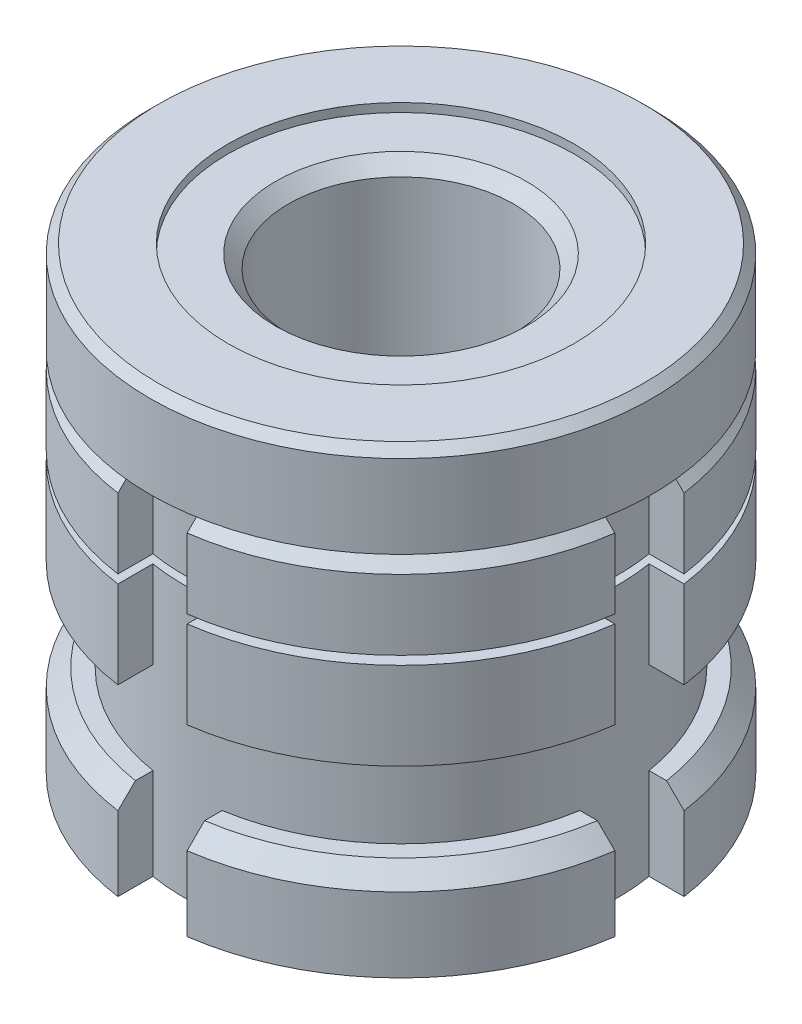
ISO-10303-21;
HEADER;
FILE_DESCRIPTION(('STEP AP214'),'2;1');
FILE_NAME('part.step','',(''),(''),'','','');
FILE_SCHEMA(('AUTOMOTIVE_DESIGN { 1 0 10303 214 1 1 1 1 }'));
ENDSEC;
DATA;
#1=APPLICATION_CONTEXT('core data for automotive mechanical design processes');
#2=APPLICATION_PROTOCOL_DEFINITION('international standard','automotive_design',2000,#1);
#3=PRODUCT_CONTEXT('',#1,'mechanical');
#4=PRODUCT('Part','Part','',(#3));
#5=PRODUCT_RELATED_PRODUCT_CATEGORY('part','',(#4));
#6=PRODUCT_DEFINITION_FORMATION('','',#4);
#7=PRODUCT_DEFINITION_CONTEXT('part definition',#1,'design');
#8=PRODUCT_DEFINITION('design','',#6,#7);
#9=PRODUCT_DEFINITION_SHAPE('','',#8);
#10=(LENGTH_UNIT() NAMED_UNIT(*) SI_UNIT(.MILLI.,.METRE.));
#11=(NAMED_UNIT(*) PLANE_ANGLE_UNIT() SI_UNIT($,.RADIAN.));
#12=(NAMED_UNIT(*) SI_UNIT($,.STERADIAN.) SOLID_ANGLE_UNIT());
#13=UNCERTAINTY_MEASURE_WITH_UNIT(LENGTH_MEASURE(1.E-05),#10,'distance_accuracy_value','');
#14=(GEOMETRIC_REPRESENTATION_CONTEXT(3) GLOBAL_UNCERTAINTY_ASSIGNED_CONTEXT((#13)) GLOBAL_UNIT_ASSIGNED_CONTEXT((#10,
#11,#12)) REPRESENTATION_CONTEXT('',''));
#15=CARTESIAN_POINT('',(0.,0.,0.));
#16=DIRECTION('',(0.,0.,1.));
#17=DIRECTION('',(1.,0.,0.));
#18=AXIS2_PLACEMENT_3D('',#15,#16,#17);
#19=CARTESIAN_POINT('',(0.,21.2,0.));
#20=DIRECTION('',(0.,-1.,0.));
#21=DIRECTION('',(0.,0.,-1.));
#22=AXIS2_PLACEMENT_3D('',#19,#20,#21);
#23=CYLINDRICAL_SURFACE('',#22,29.);
#24=DIRECTION('',(0.,1.,0.));
#25=VECTOR('',#24,1.);
#26=CARTESIAN_POINT('',(-3.99999999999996,-30.2928724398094,28.7228132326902));
#27=LINE('',#26,#25);
#28=CARTESIAN_POINT('',(-3.99999999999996,11.1,28.7228132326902));
#29=VERTEX_POINT('',#28);
#30=CARTESIAN_POINT('',(-3.99999999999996,19.2,28.7228132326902));
#31=VERTEX_POINT('',#30);
#32=EDGE_CURVE('E1108',#29,#31,#27,.T.);
#33=ORIENTED_EDGE('',*,*,#32,.T.);
#34=CARTESIAN_POINT('',(0.,19.2,0.));
#35=DIRECTION('',(0.,1.,0.));
#36=DIRECTION('',(0.,0.,1.));
#37=AXIS2_PLACEMENT_3D('',#34,#35,#36);
#38=CIRCLE('',#37,29.);
#39=CARTESIAN_POINT('',(-28.7228132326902,19.2,3.99999999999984));
#40=VERTEX_POINT('',#39);
#41=EDGE_CURVE('E55',#31,#40,#38,.F.);
#42=ORIENTED_EDGE('',*,*,#41,.T.);
#43=DIRECTION('',(0.,1.,0.));
#44=VECTOR('',#43,1.);
#45=CARTESIAN_POINT('',(-28.7228132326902,-30.2928724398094,3.99999999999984));
#46=LINE('',#45,#44);
#47=CARTESIAN_POINT('',(-28.7228132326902,11.1,3.99999999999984));
#48=VERTEX_POINT('',#47);
#49=EDGE_CURVE('E867',#48,#40,#46,.T.);
#50=ORIENTED_EDGE('',*,*,#49,.F.);
#51=CARTESIAN_POINT('',(0.,11.1,0.));
#52=DIRECTION('',(0.,1.,0.));
#53=DIRECTION('',(0.,0.,1.));
#54=AXIS2_PLACEMENT_3D('',#51,#52,#53);
#55=CIRCLE('',#54,29.);
#56=EDGE_CURVE('E586',#48,#29,#55,.T.);
#57=ORIENTED_EDGE('',*,*,#56,.T.);
#58=EDGE_LOOP('',(#33,#42,#50,#57));
#59=FACE_BOUND('',#58,.T.);
#60=ADVANCED_FACE('F39',(#59),#23,.T.);
#61=DIRECTION('',(0.,1.,0.));
#62=VECTOR('',#61,1.);
#63=CARTESIAN_POINT('',(-28.7228132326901,-30.2928724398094,-4.00000000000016));
#64=LINE('',#63,#62);
#65=CARTESIAN_POINT('',(-28.7228132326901,11.1,-4.00000000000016));
#66=VERTEX_POINT('',#65);
#67=CARTESIAN_POINT('',(-28.7228132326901,19.2,-4.00000000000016));
#68=VERTEX_POINT('',#67);
#69=EDGE_CURVE('E885',#66,#68,#64,.T.);
#70=ORIENTED_EDGE('',*,*,#69,.T.);
#71=CARTESIAN_POINT('',(0.,19.2,0.));
#72=DIRECTION('',(0.,1.,0.));
#73=DIRECTION('',(0.,0.,1.));
#74=AXIS2_PLACEMENT_3D('',#71,#72,#73);
#75=CIRCLE('',#74,29.);
#76=CARTESIAN_POINT('',(-3.99999999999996,19.2,-28.7228132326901));
#77=VERTEX_POINT('',#76);
#78=EDGE_CURVE('E643',#68,#77,#75,.F.);
#79=ORIENTED_EDGE('',*,*,#78,.T.);
#80=DIRECTION('',(0.,1.,0.));
#81=VECTOR('',#80,1.);
#82=CARTESIAN_POINT('',(-3.99999999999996,-30.2928724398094,-28.7228132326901));
#83=LINE('',#82,#81);
#84=CARTESIAN_POINT('',(-3.99999999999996,11.1,-28.7228132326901));
#85=VERTEX_POINT('',#84);
#86=EDGE_CURVE('E463',#85,#77,#83,.T.);
#87=ORIENTED_EDGE('',*,*,#86,.F.);
#88=EDGE_CURVE('E1225',#85,#66,#55,.T.);
#89=ORIENTED_EDGE('',*,*,#88,.T.);
#90=EDGE_LOOP('',(#70,#79,#87,#89));
#91=FACE_BOUND('',#90,.T.);
#92=ADVANCED_FACE('F1239',(#91),#23,.T.);
#93=DIRECTION('',(0.,1.,0.));
#94=VECTOR('',#93,1.);
#95=CARTESIAN_POINT('',(28.7228132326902,-30.2928724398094,3.9999999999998));
#96=LINE('',#95,#94);
#97=CARTESIAN_POINT('',(28.7228132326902,11.1,3.9999999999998));
#98=VERTEX_POINT('',#97);
#99=CARTESIAN_POINT('',(28.7228132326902,19.2,3.9999999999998));
#100=VERTEX_POINT('',#99);
#101=EDGE_CURVE('E1014',#98,#100,#96,.T.);
#102=ORIENTED_EDGE('',*,*,#101,.T.);
#103=CARTESIAN_POINT('',(0.,19.2,0.));
#104=DIRECTION('',(0.,1.,0.));
#105=DIRECTION('',(0.,0.,1.));
#106=AXIS2_PLACEMENT_3D('',#103,#104,#105);
#107=CIRCLE('',#106,29.);
#108=CARTESIAN_POINT('',(3.99999999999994,19.2,28.7228132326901));
#109=VERTEX_POINT('',#108);
#110=EDGE_CURVE('E726',#100,#109,#107,.F.);
#111=ORIENTED_EDGE('',*,*,#110,.T.);
#112=DIRECTION('',(0.,1.,0.));
#113=VECTOR('',#112,1.);
#114=CARTESIAN_POINT('',(3.99999999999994,-30.2928724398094,28.7228132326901));
#115=LINE('',#114,#113);
#116=CARTESIAN_POINT('',(3.99999999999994,11.1,28.7228132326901));
#117=VERTEX_POINT('',#116);
#118=EDGE_CURVE('E1098',#117,#109,#115,.T.);
#119=ORIENTED_EDGE('',*,*,#118,.F.);
#120=EDGE_CURVE('E587',#117,#98,#55,.T.);
#121=ORIENTED_EDGE('',*,*,#120,.T.);
#122=EDGE_LOOP('',(#102,#111,#119,#121));
#123=FACE_BOUND('',#122,.T.);
#124=ADVANCED_FACE('F1096',(#123),#23,.T.);
#125=CARTESIAN_POINT('',(0.,11.1,29.));
#126=DIRECTION('',(0.,1.,0.));
#127=DIRECTION('',(0.,0.,1.));
#128=AXIS2_PLACEMENT_3D('',#125,#126,#127);
#129=PLANE('',#128);
#130=CARTESIAN_POINT('',(0.,11.1,0.));
#131=DIRECTION('',(0.,1.,0.));
#132=DIRECTION('',(0.,0.,1.));
#133=AXIS2_PLACEMENT_3D('',#130,#131,#132);
#134=CIRCLE('',#133,20.);
#135=CARTESIAN_POINT('',(0.,11.1,20.));
#136=VERTEX_POINT('',#135);
#137=EDGE_CURVE('E591',#136,#136,#134,.T.);
#138=ORIENTED_EDGE('',*,*,#137,.T.);
#139=EDGE_LOOP('',(#138));
#140=FACE_BOUND('',#139,.T.);
#141=ORIENTED_EDGE('',*,*,#56,.F.);
#142=DIRECTION('',(1.,0.,0.));
#143=VECTOR('',#142,1.);
#144=CARTESIAN_POINT('',(0.,11.1,3.99999999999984));
#145=LINE('',#144,#143);
#146=CARTESIAN_POINT('',(-24.6779253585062,11.1,3.99999999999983));
#147=VERTEX_POINT('',#146);
#148=EDGE_CURVE('E562',#48,#147,#145,.T.);
#149=ORIENTED_EDGE('',*,*,#148,.T.);
#150=CARTESIAN_POINT('',(0.,11.1,0.));
#151=DIRECTION('',(0.,1.,0.));
#152=DIRECTION('',(0.,0.,1.));
#153=AXIS2_PLACEMENT_3D('',#150,#151,#152);
#154=CIRCLE('',#153,25.);
#155=CARTESIAN_POINT('',(-24.6779253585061,11.1,-4.00000000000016));
#156=VERTEX_POINT('',#155);
#157=EDGE_CURVE('E546',#147,#156,#154,.F.);
#158=ORIENTED_EDGE('',*,*,#157,.T.);
#159=DIRECTION('',(-1.,0.,0.));
#160=VECTOR('',#159,1.);
#161=CARTESIAN_POINT('',(0.,11.1,-4.00000000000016));
#162=LINE('',#161,#160);
#163=EDGE_CURVE('E539',#156,#66,#162,.T.);
#164=ORIENTED_EDGE('',*,*,#163,.T.);
#165=ORIENTED_EDGE('',*,*,#88,.F.);
#166=DIRECTION('',(0.,0.,1.));
#167=VECTOR('',#166,1.);
#168=CARTESIAN_POINT('',(-3.99999999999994,11.1,29.));
#169=LINE('',#168,#167);
#170=CARTESIAN_POINT('',(-3.99999999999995,11.1,-24.6779253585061));
#171=VERTEX_POINT('',#170);
#172=EDGE_CURVE('E525',#85,#171,#169,.T.);
#173=ORIENTED_EDGE('',*,*,#172,.T.);
#174=CARTESIAN_POINT('',(0.,11.1,0.));
#175=DIRECTION('',(0.,1.,0.));
#176=DIRECTION('',(0.,0.,1.));
#177=AXIS2_PLACEMENT_3D('',#174,#175,#176);
#178=CIRCLE('',#177,25.);
#179=CARTESIAN_POINT('',(3.99999999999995,11.1,-24.6779253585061));
#180=VERTEX_POINT('',#179);
#181=EDGE_CURVE('E422',#171,#180,#178,.F.);
#182=ORIENTED_EDGE('',*,*,#181,.T.);
#183=DIRECTION('',(0.,0.,-1.));
#184=VECTOR('',#183,1.);
#185=CARTESIAN_POINT('',(3.99999999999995,11.1,29.));
#186=LINE('',#185,#184);
#187=CARTESIAN_POINT('',(3.99999999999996,11.1,-28.7228132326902));
#188=VERTEX_POINT('',#187);
#189=EDGE_CURVE('E500',#180,#188,#186,.T.);
#190=ORIENTED_EDGE('',*,*,#189,.T.);
#191=CARTESIAN_POINT('',(28.7228132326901,11.1,-4.00000000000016));
#192=VERTEX_POINT('',#191);
#193=EDGE_CURVE('E592',#192,#188,#55,.T.);
#194=ORIENTED_EDGE('',*,*,#193,.F.);
#195=DIRECTION('',(-1.,0.,0.));
#196=VECTOR('',#195,1.);
#197=CARTESIAN_POINT('',(0.,11.1,-4.00000000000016));
#198=LINE('',#197,#196);
#199=CARTESIAN_POINT('',(24.6779253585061,11.1,-4.00000000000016));
#200=VERTEX_POINT('',#199);
#201=EDGE_CURVE('E1060',#192,#200,#198,.T.);
#202=ORIENTED_EDGE('',*,*,#201,.T.);
#203=CARTESIAN_POINT('',(0.,11.1,0.));
#204=DIRECTION('',(0.,1.,0.));
#205=DIRECTION('',(0.,0.,1.));
#206=AXIS2_PLACEMENT_3D('',#203,#204,#205);
#207=CIRCLE('',#206,25.);
#208=CARTESIAN_POINT('',(24.6779253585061,11.1,3.9999999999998));
#209=VERTEX_POINT('',#208);
#210=EDGE_CURVE('E1058',#200,#209,#207,.F.);
#211=ORIENTED_EDGE('',*,*,#210,.T.);
#212=DIRECTION('',(1.,0.,0.));
#213=VECTOR('',#212,1.);
#214=CARTESIAN_POINT('',(0.,11.1,3.99999999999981));
#215=LINE('',#214,#213);
#216=EDGE_CURVE('E985',#209,#98,#215,.T.);
#217=ORIENTED_EDGE('',*,*,#216,.T.);
#218=ORIENTED_EDGE('',*,*,#120,.F.);
#219=DIRECTION('',(0.,0.,-1.));
#220=VECTOR('',#219,1.);
#221=CARTESIAN_POINT('',(3.99999999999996,11.1,29.));
#222=LINE('',#221,#220);
#223=CARTESIAN_POINT('',(3.99999999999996,11.1,24.6779253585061));
#224=VERTEX_POINT('',#223);
#225=EDGE_CURVE('E848',#117,#224,#222,.T.);
#226=ORIENTED_EDGE('',*,*,#225,.T.);
#227=CARTESIAN_POINT('',(0.,11.1,0.));
#228=DIRECTION('',(0.,1.,0.));
#229=DIRECTION('',(0.,0.,1.));
#230=AXIS2_PLACEMENT_3D('',#227,#228,#229);
#231=CIRCLE('',#230,25.);
#232=CARTESIAN_POINT('',(-3.99999999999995,11.1,24.6779253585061));
#233=VERTEX_POINT('',#232);
#234=EDGE_CURVE('E872',#224,#233,#231,.F.);
#235=ORIENTED_EDGE('',*,*,#234,.T.);
#236=DIRECTION('',(0.,0.,1.));
#237=VECTOR('',#236,1.);
#238=CARTESIAN_POINT('',(-3.99999999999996,11.1,29.));
#239=LINE('',#238,#237);
#240=EDGE_CURVE('E1154',#233,#29,#239,.T.);
#241=ORIENTED_EDGE('',*,*,#240,.T.);
#242=EDGE_LOOP('',(#141,#149,#158,#164,#165,#173,#182,#190,#194,#202,#211,#217,#218,#226,#235,#241));
#243=FACE_BOUND('',#242,.T.);
#244=ADVANCED_FACE('F1064',(#140,#243),#129,.F.);
#245=CARTESIAN_POINT('',(0.,10.1,29.));
#246=DIRECTION('',(0.,-1.,0.));
#247=DIRECTION('',(0.,0.,-1.));
#248=AXIS2_PLACEMENT_3D('',#245,#246,#247);
#249=PLANE('',#248);
#250=CARTESIAN_POINT('',(0.,10.1,0.));
#251=DIRECTION('',(0.,1.,0.));
#252=DIRECTION('',(0.,0.,1.));
#253=AXIS2_PLACEMENT_3D('',#250,#251,#252);
#254=CIRCLE('',#253,20.);
#255=CARTESIAN_POINT('',(0.,10.1,20.));
#256=VERTEX_POINT('',#255);
#257=EDGE_CURVE('E571',#256,#256,#254,.T.);
#258=ORIENTED_EDGE('',*,*,#257,.F.);
#259=EDGE_LOOP('',(#258));
#260=FACE_BOUND('',#259,.T.);
#261=CARTESIAN_POINT('',(0.,10.1,0.));
#262=DIRECTION('',(0.,-1.,0.));
#263=DIRECTION('',(0.,0.,-1.));
#264=AXIS2_PLACEMENT_3D('',#261,#262,#263);
#265=CIRCLE('',#264,25.);
#266=CARTESIAN_POINT('',(-24.6779253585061,10.1,-4.00000000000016));
#267=VERTEX_POINT('',#266);
#268=CARTESIAN_POINT('',(-24.6779253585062,10.1,3.99999999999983));
#269=VERTEX_POINT('',#268);
#270=EDGE_CURVE('E543',#267,#269,#265,.F.);
#271=ORIENTED_EDGE('',*,*,#270,.T.);
#272=DIRECTION('',(-1.,0.,0.));
#273=VECTOR('',#272,1.);
#274=CARTESIAN_POINT('',(0.,10.1,3.99999999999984));
#275=LINE('',#274,#273);
#276=CARTESIAN_POINT('',(-28.7228132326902,10.1,3.99999999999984));
#277=VERTEX_POINT('',#276);
#278=EDGE_CURVE('E558',#269,#277,#275,.T.);
#279=ORIENTED_EDGE('',*,*,#278,.T.);
#280=CARTESIAN_POINT('',(0.,10.1,0.));
#281=DIRECTION('',(0.,1.,0.));
#282=DIRECTION('',(0.,0.,1.));
#283=AXIS2_PLACEMENT_3D('',#280,#281,#282);
#284=CIRCLE('',#283,29.);
#285=CARTESIAN_POINT('',(-3.99999999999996,10.1,28.7228132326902));
#286=VERTEX_POINT('',#285);
#287=EDGE_CURVE('E581',#277,#286,#284,.T.);
#288=ORIENTED_EDGE('',*,*,#287,.T.);
#289=DIRECTION('',(0.,0.,-1.));
#290=VECTOR('',#289,1.);
#291=CARTESIAN_POINT('',(-3.99999999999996,10.1,29.));
#292=LINE('',#291,#290);
#293=CARTESIAN_POINT('',(-3.99999999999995,10.1,24.6779253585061));
#294=VERTEX_POINT('',#293);
#295=EDGE_CURVE('E1149',#286,#294,#292,.T.);
#296=ORIENTED_EDGE('',*,*,#295,.T.);
#297=CARTESIAN_POINT('',(0.,10.1,0.));
#298=DIRECTION('',(0.,-1.,0.));
#299=DIRECTION('',(0.,0.,-1.));
#300=AXIS2_PLACEMENT_3D('',#297,#298,#299);
#301=CIRCLE('',#300,25.);
#302=CARTESIAN_POINT('',(3.99999999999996,10.1,24.6779253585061));
#303=VERTEX_POINT('',#302);
#304=EDGE_CURVE('E864',#294,#303,#301,.F.);
#305=ORIENTED_EDGE('',*,*,#304,.T.);
#306=DIRECTION('',(0.,0.,1.));
#307=VECTOR('',#306,1.);
#308=CARTESIAN_POINT('',(3.99999999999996,10.1,29.));
#309=LINE('',#308,#307);
#310=CARTESIAN_POINT('',(3.99999999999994,10.1,28.7228132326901));
#311=VERTEX_POINT('',#310);
#312=EDGE_CURVE('E1146',#303,#311,#309,.T.);
#313=ORIENTED_EDGE('',*,*,#312,.T.);
#314=CARTESIAN_POINT('',(28.7228132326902,10.1,3.9999999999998));
#315=VERTEX_POINT('',#314);
#316=EDGE_CURVE('E582',#311,#315,#284,.T.);
#317=ORIENTED_EDGE('',*,*,#316,.T.);
#318=DIRECTION('',(-1.,0.,0.));
#319=VECTOR('',#318,1.);
#320=CARTESIAN_POINT('',(0.,10.1,3.99999999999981));
#321=LINE('',#320,#319);
#322=CARTESIAN_POINT('',(24.6779253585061,10.1,3.9999999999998));
#323=VERTEX_POINT('',#322);
#324=EDGE_CURVE('E1084',#315,#323,#321,.T.);
#325=ORIENTED_EDGE('',*,*,#324,.T.);
#326=CARTESIAN_POINT('',(0.,10.1,0.));
#327=DIRECTION('',(0.,-1.,0.));
#328=DIRECTION('',(0.,0.,-1.));
#329=AXIS2_PLACEMENT_3D('',#326,#327,#328);
#330=CIRCLE('',#329,25.);
#331=CARTESIAN_POINT('',(24.6779253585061,10.1,-4.00000000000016));
#332=VERTEX_POINT('',#331);
#333=EDGE_CURVE('E1158',#323,#332,#330,.F.);
#334=ORIENTED_EDGE('',*,*,#333,.T.);
#335=DIRECTION('',(1.,0.,0.));
#336=VECTOR('',#335,1.);
#337=CARTESIAN_POINT('',(0.,10.1,-4.00000000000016));
#338=LINE('',#337,#336);
#339=CARTESIAN_POINT('',(28.7228132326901,10.1,-4.00000000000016));
#340=VERTEX_POINT('',#339);
#341=EDGE_CURVE('E1069',#332,#340,#338,.T.);
#342=ORIENTED_EDGE('',*,*,#341,.T.);
#343=CARTESIAN_POINT('',(3.99999999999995,10.1,-28.7228132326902));
#344=VERTEX_POINT('',#343);
#345=EDGE_CURVE('E498',#340,#344,#284,.T.);
#346=ORIENTED_EDGE('',*,*,#345,.T.);
#347=DIRECTION('',(0.,0.,1.));
#348=VECTOR('',#347,1.);
#349=CARTESIAN_POINT('',(3.99999999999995,10.1,29.));
#350=LINE('',#349,#348);
#351=CARTESIAN_POINT('',(3.99999999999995,10.1,-24.6779253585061));
#352=VERTEX_POINT('',#351);
#353=EDGE_CURVE('E482',#344,#352,#350,.T.);
#354=ORIENTED_EDGE('',*,*,#353,.T.);
#355=CARTESIAN_POINT('',(0.,10.1,0.));
#356=DIRECTION('',(0.,-1.,0.));
#357=DIRECTION('',(0.,0.,-1.));
#358=AXIS2_PLACEMENT_3D('',#355,#356,#357);
#359=CIRCLE('',#358,25.);
#360=CARTESIAN_POINT('',(-3.99999999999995,10.1,-24.6779253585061));
#361=VERTEX_POINT('',#360);
#362=EDGE_CURVE('E495',#352,#361,#359,.F.);
#363=ORIENTED_EDGE('',*,*,#362,.T.);
#364=DIRECTION('',(0.,0.,-1.));
#365=VECTOR('',#364,1.);
#366=CARTESIAN_POINT('',(-3.99999999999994,10.1,29.));
#367=LINE('',#366,#365);
#368=CARTESIAN_POINT('',(-3.99999999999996,10.1,-28.7228132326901));
#369=VERTEX_POINT('',#368);
#370=EDGE_CURVE('E522',#361,#369,#367,.T.);
#371=ORIENTED_EDGE('',*,*,#370,.T.);
#372=CARTESIAN_POINT('',(-28.7228132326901,10.1,-4.00000000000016));
#373=VERTEX_POINT('',#372);
#374=EDGE_CURVE('E1924',#369,#373,#284,.T.);
#375=ORIENTED_EDGE('',*,*,#374,.T.);
#376=DIRECTION('',(1.,0.,0.));
#377=VECTOR('',#376,1.);
#378=CARTESIAN_POINT('',(0.,10.1,-4.00000000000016));
#379=LINE('',#378,#377);
#380=EDGE_CURVE('E535',#373,#267,#379,.T.);
#381=ORIENTED_EDGE('',*,*,#380,.T.);
#382=EDGE_LOOP('',(#271,#279,#288,#296,#305,#313,#317,#325,#334,#342,#346,#354,#363,#371,#375,#381));
#383=FACE_BOUND('',#382,.T.);
#384=ADVANCED_FACE('F493',(#260,#383),#249,.F.);
#385=CARTESIAN_POINT('',(0.,0.,0.));
#386=DIRECTION('',(0.,1.,0.));
#387=DIRECTION('',(0.,0.,1.));
#388=AXIS2_PLACEMENT_3D('',#385,#386,#387);
#389=PLANE('',#388);
#390=CARTESIAN_POINT('',(0.,0.,0.));
#391=DIRECTION('',(0.,1.,0.));
#392=DIRECTION('',(0.,0.,1.));
#393=AXIS2_PLACEMENT_3D('',#390,#391,#392);
#394=CIRCLE('',#393,29.);
#395=CARTESIAN_POINT('',(-28.7228132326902,0.,3.99999999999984));
#396=VERTEX_POINT('',#395);
#397=CARTESIAN_POINT('',(-3.99999999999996,0.,28.7228132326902));
#398=VERTEX_POINT('',#397);
#399=EDGE_CURVE('E596',#396,#398,#394,.T.);
#400=ORIENTED_EDGE('',*,*,#399,.F.);
#401=DIRECTION('',(1.,0.,0.));
#402=VECTOR('',#401,1.);
#403=CARTESIAN_POINT('',(0.,0.,3.99999999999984));
#404=LINE('',#403,#402);
#405=CARTESIAN_POINT('',(-24.6779253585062,0.,3.99999999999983));
#406=VERTEX_POINT('',#405);
#407=EDGE_CURVE('E554',#396,#406,#404,.T.);
#408=ORIENTED_EDGE('',*,*,#407,.T.);
#409=CARTESIAN_POINT('',(0.,0.,0.));
#410=DIRECTION('',(0.,-1.,0.));
#411=DIRECTION('',(0.,0.,-1.));
#412=AXIS2_PLACEMENT_3D('',#409,#410,#411);
#413=CIRCLE('',#412,25.);
#414=CARTESIAN_POINT('',(-3.99999999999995,0.,24.6779253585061));
#415=VERTEX_POINT('',#414);
#416=EDGE_CURVE('E1293',#415,#406,#413,.T.);
#417=ORIENTED_EDGE('',*,*,#416,.F.);
#418=DIRECTION('',(0.,0.,1.));
#419=VECTOR('',#418,1.);
#420=CARTESIAN_POINT('',(-3.99999999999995,0.,0.));
#421=LINE('',#420,#419);
#422=EDGE_CURVE('E847',#415,#398,#421,.T.);
#423=ORIENTED_EDGE('',*,*,#422,.T.);
#424=EDGE_LOOP('',(#400,#408,#417,#423));
#425=FACE_BOUND('',#424,.T.);
#426=ADVANCED_FACE('F1254',(#425),#389,.F.);
#427=CARTESIAN_POINT('',(-24.6779253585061,0.,-4.00000000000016));
#428=VERTEX_POINT('',#427);
#429=CARTESIAN_POINT('',(-3.99999999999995,0.,-24.6779253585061));
#430=VERTEX_POINT('',#429);
#431=EDGE_CURVE('E577',#428,#430,#413,.T.);
#432=ORIENTED_EDGE('',*,*,#431,.F.);
#433=DIRECTION('',(-1.,0.,0.));
#434=VECTOR('',#433,1.);
#435=CARTESIAN_POINT('',(0.,0.,-4.00000000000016));
#436=LINE('',#435,#434);
#437=CARTESIAN_POINT('',(-28.7228132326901,0.,-4.00000000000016));
#438=VERTEX_POINT('',#437);
#439=EDGE_CURVE('E531',#428,#438,#436,.T.);
#440=ORIENTED_EDGE('',*,*,#439,.T.);
#441=CARTESIAN_POINT('',(-3.99999999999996,0.,-28.7228132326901));
#442=VERTEX_POINT('',#441);
#443=EDGE_CURVE('E1280',#442,#438,#394,.T.);
#444=ORIENTED_EDGE('',*,*,#443,.F.);
#445=DIRECTION('',(0.,0.,1.));
#446=VECTOR('',#445,1.);
#447=CARTESIAN_POINT('',(-3.99999999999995,0.,0.));
#448=LINE('',#447,#446);
#449=EDGE_CURVE('E518',#442,#430,#448,.T.);
#450=ORIENTED_EDGE('',*,*,#449,.T.);
#451=EDGE_LOOP('',(#432,#440,#444,#450));
#452=FACE_BOUND('',#451,.T.);
#453=ADVANCED_FACE('F1823',(#452),#389,.F.);
#454=CARTESIAN_POINT('',(24.6779253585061,0.,3.9999999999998));
#455=VERTEX_POINT('',#454);
#456=CARTESIAN_POINT('',(3.99999999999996,0.,24.6779253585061));
#457=VERTEX_POINT('',#456);
#458=EDGE_CURVE('E576',#455,#457,#413,.T.);
#459=ORIENTED_EDGE('',*,*,#458,.F.);
#460=DIRECTION('',(1.,0.,0.));
#461=VECTOR('',#460,1.);
#462=CARTESIAN_POINT('',(0.,0.,3.9999999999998));
#463=LINE('',#462,#461);
#464=CARTESIAN_POINT('',(28.7228132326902,0.,3.9999999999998));
#465=VERTEX_POINT('',#464);
#466=EDGE_CURVE('E1074',#455,#465,#463,.T.);
#467=ORIENTED_EDGE('',*,*,#466,.T.);
#468=CARTESIAN_POINT('',(3.99999999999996,0.,28.7228132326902));
#469=VERTEX_POINT('',#468);
#470=EDGE_CURVE('E597',#469,#465,#394,.T.);
#471=ORIENTED_EDGE('',*,*,#470,.F.);
#472=DIRECTION('',(0.,0.,-1.));
#473=VECTOR('',#472,1.);
#474=CARTESIAN_POINT('',(3.99999999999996,0.,0.));
#475=LINE('',#474,#473);
#476=EDGE_CURVE('E1186',#469,#457,#475,.T.);
#477=ORIENTED_EDGE('',*,*,#476,.T.);
#478=EDGE_LOOP('',(#459,#467,#471,#477));
#479=FACE_BOUND('',#478,.T.);
#480=ADVANCED_FACE('F1185',(#479),#389,.F.);
#481=ORIENTED_EDGE('',*,*,#287,.F.);
#482=EDGE_CURVE('E865',#396,#277,#46,.T.);
#483=ORIENTED_EDGE('',*,*,#482,.F.);
#484=ORIENTED_EDGE('',*,*,#399,.T.);
#485=EDGE_CURVE('E1106',#398,#286,#27,.T.);
#486=ORIENTED_EDGE('',*,*,#485,.T.);
#487=EDGE_LOOP('',(#481,#483,#484,#486));
#488=FACE_BOUND('',#487,.T.);
#489=ADVANCED_FACE('F1271',(#488),#23,.T.);
#490=ORIENTED_EDGE('',*,*,#443,.T.);
#491=EDGE_CURVE('E883',#438,#373,#64,.T.);
#492=ORIENTED_EDGE('',*,*,#491,.T.);
#493=ORIENTED_EDGE('',*,*,#374,.F.);
#494=EDGE_CURVE('E949',#442,#369,#83,.T.);
#495=ORIENTED_EDGE('',*,*,#494,.F.);
#496=EDGE_LOOP('',(#490,#492,#493,#495));
#497=FACE_BOUND('',#496,.T.);
#498=ADVANCED_FACE('F1265',(#497),#23,.T.);
#499=ORIENTED_EDGE('',*,*,#470,.T.);
#500=EDGE_CURVE('E1013',#465,#315,#96,.T.);
#501=ORIENTED_EDGE('',*,*,#500,.T.);
#502=ORIENTED_EDGE('',*,*,#316,.F.);
#503=EDGE_CURVE('E1101',#469,#311,#115,.T.);
#504=ORIENTED_EDGE('',*,*,#503,.F.);
#505=EDGE_LOOP('',(#499,#501,#502,#504));
#506=FACE_BOUND('',#505,.T.);
#507=ADVANCED_FACE('F1181',(#506),#23,.T.);
#508=CARTESIAN_POINT('',(0.,-10.6,0.));
#509=DIRECTION('',(0.,-1.,0.));
#510=DIRECTION('',(0.,0.,-1.));
#511=AXIS2_PLACEMENT_3D('',#508,#509,#510);
#512=CYLINDRICAL_SURFACE('',#511,29.);
#513=CARTESIAN_POINT('',(-3.99999999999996,-21.2,28.7228132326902));
#514=VERTEX_POINT('',#513);
#515=CARTESIAN_POINT('',(-3.99999999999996,-12.6,28.7228132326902));
#516=VERTEX_POINT('',#515);
#517=EDGE_CURVE('E858',#514,#516,#27,.T.);
#518=ORIENTED_EDGE('',*,*,#517,.T.);
#519=CARTESIAN_POINT('',(0.,-12.6,0.));
#520=DIRECTION('',(0.,-1.,0.));
#521=DIRECTION('',(0.,0.,-1.));
#522=AXIS2_PLACEMENT_3D('',#519,#520,#521);
#523=CIRCLE('',#522,29.);
#524=CARTESIAN_POINT('',(-28.7228132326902,-12.6,3.99999999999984));
#525=VERTEX_POINT('',#524);
#526=EDGE_CURVE('E774',#516,#525,#523,.T.);
#527=ORIENTED_EDGE('',*,*,#526,.T.);
#528=CARTESIAN_POINT('',(-28.7228132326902,-21.2,3.99999999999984));
#529=VERTEX_POINT('',#528);
#530=EDGE_CURVE('E856',#529,#525,#46,.T.);
#531=ORIENTED_EDGE('',*,*,#530,.F.);
#532=CARTESIAN_POINT('',(0.,-21.2,0.));
#533=DIRECTION('',(0.,-1.,0.));
#534=DIRECTION('',(0.,0.,-1.));
#535=AXIS2_PLACEMENT_3D('',#532,#533,#534);
#536=CIRCLE('',#535,29.);
#537=EDGE_CURVE('E1926',#514,#529,#536,.T.);
#538=ORIENTED_EDGE('',*,*,#537,.F.);
#539=EDGE_LOOP('',(#518,#527,#531,#538));
#540=FACE_BOUND('',#539,.T.);
#541=ADVANCED_FACE('F854',(#540),#512,.T.);
#542=CARTESIAN_POINT('',(-28.7228132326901,-21.2,-4.00000000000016));
#543=VERTEX_POINT('',#542);
#544=CARTESIAN_POINT('',(-28.7228132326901,-12.6,-4.00000000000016));
#545=VERTEX_POINT('',#544);
#546=EDGE_CURVE('E878',#543,#545,#64,.T.);
#547=ORIENTED_EDGE('',*,*,#546,.T.);
#548=CARTESIAN_POINT('',(0.,-12.6,0.));
#549=DIRECTION('',(0.,-1.,0.));
#550=DIRECTION('',(0.,0.,-1.));
#551=AXIS2_PLACEMENT_3D('',#548,#549,#550);
#552=CIRCLE('',#551,29.);
#553=CARTESIAN_POINT('',(-3.99999999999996,-12.6,-28.7228132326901));
#554=VERTEX_POINT('',#553);
#555=EDGE_CURVE('E605',#545,#554,#552,.T.);
#556=ORIENTED_EDGE('',*,*,#555,.T.);
#557=CARTESIAN_POINT('',(-3.99999999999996,-21.2,-28.7228132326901));
#558=VERTEX_POINT('',#557);
#559=EDGE_CURVE('E946',#558,#554,#83,.T.);
#560=ORIENTED_EDGE('',*,*,#559,.F.);
#561=EDGE_CURVE('E566',#543,#558,#536,.T.);
#562=ORIENTED_EDGE('',*,*,#561,.F.);
#563=EDGE_LOOP('',(#547,#556,#560,#562));
#564=FACE_BOUND('',#563,.T.);
#565=ADVANCED_FACE('F1270',(#564),#512,.T.);
#566=CARTESIAN_POINT('',(28.7228132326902,-21.2,3.9999999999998));
#567=VERTEX_POINT('',#566);
#568=CARTESIAN_POINT('',(28.7228132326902,-12.6,3.9999999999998));
#569=VERTEX_POINT('',#568);
#570=EDGE_CURVE('E1008',#567,#569,#96,.T.);
#571=ORIENTED_EDGE('',*,*,#570,.T.);
#572=CARTESIAN_POINT('',(0.,-12.6,0.));
#573=DIRECTION('',(0.,-1.,0.));
#574=DIRECTION('',(0.,0.,-1.));
#575=AXIS2_PLACEMENT_3D('',#572,#573,#574);
#576=CIRCLE('',#575,29.);
#577=CARTESIAN_POINT('',(3.99999999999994,-12.6,28.7228132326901));
#578=VERTEX_POINT('',#577);
#579=EDGE_CURVE('E745',#569,#578,#576,.T.);
#580=ORIENTED_EDGE('',*,*,#579,.T.);
#581=CARTESIAN_POINT('',(3.99999999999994,-21.2,28.7228132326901));
#582=VERTEX_POINT('',#581);
#583=EDGE_CURVE('E1103',#582,#578,#115,.T.);
#584=ORIENTED_EDGE('',*,*,#583,.F.);
#585=EDGE_CURVE('E572',#567,#582,#536,.T.);
#586=ORIENTED_EDGE('',*,*,#585,.F.);
#587=EDGE_LOOP('',(#571,#580,#584,#586));
#588=FACE_BOUND('',#587,.T.);
#589=ADVANCED_FACE('F1252',(#588),#512,.T.);
#590=CARTESIAN_POINT('',(0.,-10.6,0.));
#591=DIRECTION('',(0.,-1.,0.));
#592=DIRECTION('',(0.,0.,-1.));
#593=AXIS2_PLACEMENT_3D('',#590,#591,#592);
#594=PLANE('',#593);
#595=DIRECTION('',(-1.,0.,0.));
#596=VECTOR('',#595,1.);
#597=CARTESIAN_POINT('',(0.,-10.6,3.99999999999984));
#598=LINE('',#597,#596);
#599=CARTESIAN_POINT('',(-24.6779253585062,-10.6,3.99999999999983));
#600=VERTEX_POINT('',#599);
#601=CARTESIAN_POINT('',(-26.7020598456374,-10.6,3.99999999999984));
#602=VERTEX_POINT('',#601);
#603=EDGE_CURVE('E550',#600,#602,#598,.T.);
#604=ORIENTED_EDGE('',*,*,#603,.T.);
#605=CARTESIAN_POINT('',(0.,-10.6,0.));
#606=DIRECTION('',(0.,-1.,0.));
#607=DIRECTION('',(0.,0.,-1.));
#608=AXIS2_PLACEMENT_3D('',#605,#606,#607);
#609=CIRCLE('',#608,27.);
#610=CARTESIAN_POINT('',(-3.99999999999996,-10.6,26.7020598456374));
#611=VERTEX_POINT('',#610);
#612=EDGE_CURVE('E784',#602,#611,#609,.F.);
#613=ORIENTED_EDGE('',*,*,#612,.T.);
#614=DIRECTION('',(0.,0.,-1.));
#615=VECTOR('',#614,1.);
#616=CARTESIAN_POINT('',(-3.99999999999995,-10.6,0.));
#617=LINE('',#616,#615);
#618=CARTESIAN_POINT('',(-3.99999999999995,-10.6,24.6779253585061));
#619=VERTEX_POINT('',#618);
#620=EDGE_CURVE('E839',#611,#619,#617,.T.);
#621=ORIENTED_EDGE('',*,*,#620,.T.);
#622=CARTESIAN_POINT('',(0.,-10.6,0.));
#623=DIRECTION('',(0.,-1.,0.));
#624=DIRECTION('',(0.,0.,-1.));
#625=AXIS2_PLACEMENT_3D('',#622,#623,#624);
#626=CIRCLE('',#625,25.);
#627=EDGE_CURVE('E1933',#619,#600,#626,.T.);
#628=ORIENTED_EDGE('',*,*,#627,.T.);
#629=EDGE_LOOP('',(#604,#613,#621,#628));
#630=FACE_BOUND('',#629,.T.);
#631=ADVANCED_FACE('F837',(#630),#594,.F.);
#632=DIRECTION('',(0.,0.,-1.));
#633=VECTOR('',#632,1.);
#634=CARTESIAN_POINT('',(-3.99999999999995,-10.6,0.));
#635=LINE('',#634,#633);
#636=CARTESIAN_POINT('',(-3.99999999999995,-10.6,-24.6779253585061));
#637=VERTEX_POINT('',#636);
#638=CARTESIAN_POINT('',(-3.99999999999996,-10.6,-26.7020598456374));
#639=VERTEX_POINT('',#638);
#640=EDGE_CURVE('E514',#637,#639,#635,.T.);
#641=ORIENTED_EDGE('',*,*,#640,.T.);
#642=CARTESIAN_POINT('',(0.,-10.6,0.));
#643=DIRECTION('',(0.,-1.,0.));
#644=DIRECTION('',(0.,0.,-1.));
#645=AXIS2_PLACEMENT_3D('',#642,#643,#644);
#646=CIRCLE('',#645,27.);
#647=CARTESIAN_POINT('',(-26.7020598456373,-10.6,-4.00000000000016));
#648=VERTEX_POINT('',#647);
#649=EDGE_CURVE('E618',#639,#648,#646,.F.);
#650=ORIENTED_EDGE('',*,*,#649,.T.);
#651=DIRECTION('',(1.,0.,0.));
#652=VECTOR('',#651,1.);
#653=CARTESIAN_POINT('',(0.,-10.6,-4.00000000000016));
#654=LINE('',#653,#652);
#655=CARTESIAN_POINT('',(-24.6779253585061,-10.6,-4.00000000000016));
#656=VERTEX_POINT('',#655);
#657=EDGE_CURVE('E528',#648,#656,#654,.T.);
#658=ORIENTED_EDGE('',*,*,#657,.T.);
#659=EDGE_CURVE('E575',#656,#637,#626,.T.);
#660=ORIENTED_EDGE('',*,*,#659,.T.);
#661=EDGE_LOOP('',(#641,#650,#658,#660));
#662=FACE_BOUND('',#661,.T.);
#663=ADVANCED_FACE('F1766',(#662),#594,.F.);
#664=DIRECTION('',(0.,0.,1.));
#665=VECTOR('',#664,1.);
#666=CARTESIAN_POINT('',(3.99999999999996,-10.6,0.));
#667=LINE('',#666,#665);
#668=CARTESIAN_POINT('',(3.99999999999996,-10.6,24.6779253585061));
#669=VERTEX_POINT('',#668);
#670=CARTESIAN_POINT('',(3.99999999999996,-10.6,26.7020598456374));
#671=VERTEX_POINT('',#670);
#672=EDGE_CURVE('E1212',#669,#671,#667,.T.);
#673=ORIENTED_EDGE('',*,*,#672,.T.);
#674=CARTESIAN_POINT('',(0.,-10.6,0.));
#675=DIRECTION('',(0.,-1.,0.));
#676=DIRECTION('',(0.,0.,-1.));
#677=AXIS2_PLACEMENT_3D('',#674,#675,#676);
#678=CIRCLE('',#677,27.);
#679=CARTESIAN_POINT('',(26.7020598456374,-10.6,3.9999999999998));
#680=VERTEX_POINT('',#679);
#681=EDGE_CURVE('E765',#671,#680,#678,.F.);
#682=ORIENTED_EDGE('',*,*,#681,.T.);
#683=DIRECTION('',(-1.,0.,0.));
#684=VECTOR('',#683,1.);
#685=CARTESIAN_POINT('',(0.,-10.6,3.9999999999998));
#686=LINE('',#685,#684);
#687=CARTESIAN_POINT('',(24.6779253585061,-10.6,3.9999999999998));
#688=VERTEX_POINT('',#687);
#689=EDGE_CURVE('E1068',#680,#688,#686,.T.);
#690=ORIENTED_EDGE('',*,*,#689,.T.);
#691=EDGE_CURVE('E606',#688,#669,#626,.T.);
#692=ORIENTED_EDGE('',*,*,#691,.T.);
#693=EDGE_LOOP('',(#673,#682,#690,#692));
#694=FACE_BOUND('',#693,.T.);
#695=ADVANCED_FACE('F1708',(#694),#594,.F.);
#696=CARTESIAN_POINT('',(0.,-21.2,0.));
#697=DIRECTION('',(0.,-1.,0.));
#698=DIRECTION('',(0.,0.,-1.));
#699=AXIS2_PLACEMENT_3D('',#696,#697,#698);
#700=PLANE('',#699);
#701=CARTESIAN_POINT('',(0.,-21.2,0.));
#702=DIRECTION('',(0.,-1.,0.));
#703=DIRECTION('',(0.,0.,-1.));
#704=AXIS2_PLACEMENT_3D('',#701,#702,#703);
#705=CIRCLE('',#704,14.5);
#706=CARTESIAN_POINT('',(0.,-21.2,-14.5));
#707=VERTEX_POINT('',#706);
#708=EDGE_CURVE('E1297',#707,#707,#705,.F.);
#709=ORIENTED_EDGE('',*,*,#708,.T.);
#710=EDGE_LOOP('',(#709));
#711=FACE_BOUND('',#710,.T.);
#712=DIRECTION('',(1.,0.,0.));
#713=VECTOR('',#712,1.);
#714=CARTESIAN_POINT('',(-24.6779253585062,-21.2,3.99999999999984));
#715=LINE('',#714,#713);
#716=CARTESIAN_POINT('',(-24.6779253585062,-21.2,3.99999999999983));
#717=VERTEX_POINT('',#716);
#718=EDGE_CURVE('E862',#529,#717,#715,.T.);
#719=ORIENTED_EDGE('',*,*,#718,.T.);
#720=CARTESIAN_POINT('',(0.,-21.2,0.));
#721=DIRECTION('',(0.,-1.,0.));
#722=DIRECTION('',(0.,0.,-1.));
#723=AXIS2_PLACEMENT_3D('',#720,#721,#722);
#724=CIRCLE('',#723,25.);
#725=CARTESIAN_POINT('',(-24.6779253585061,-21.2,-4.00000000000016));
#726=VERTEX_POINT('',#725);
#727=EDGE_CURVE('E914',#717,#726,#724,.T.);
#728=ORIENTED_EDGE('',*,*,#727,.T.);
#729=DIRECTION('',(-1.,0.,0.));
#730=VECTOR('',#729,1.);
#731=CARTESIAN_POINT('',(-28.7228132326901,-21.2,-4.00000000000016));
#732=LINE('',#731,#730);
#733=EDGE_CURVE('E895',#726,#543,#732,.T.);
#734=ORIENTED_EDGE('',*,*,#733,.T.);
#735=ORIENTED_EDGE('',*,*,#561,.T.);
#736=DIRECTION('',(0.,0.,1.));
#737=VECTOR('',#736,1.);
#738=CARTESIAN_POINT('',(-3.99999999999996,-21.2,-28.7228132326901));
#739=LINE('',#738,#737);
#740=CARTESIAN_POINT('',(-3.99999999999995,-21.2,-24.6779253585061));
#741=VERTEX_POINT('',#740);
#742=EDGE_CURVE('E425',#558,#741,#739,.T.);
#743=ORIENTED_EDGE('',*,*,#742,.T.);
#744=CARTESIAN_POINT('',(0.,-21.2,0.));
#745=DIRECTION('',(0.,-1.,0.));
#746=DIRECTION('',(0.,0.,-1.));
#747=AXIS2_PLACEMENT_3D('',#744,#745,#746);
#748=CIRCLE('',#747,25.);
#749=CARTESIAN_POINT('',(3.99999999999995,-21.2,-24.6779253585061));
#750=VERTEX_POINT('',#749);
#751=EDGE_CURVE('E439',#741,#750,#748,.T.);
#752=ORIENTED_EDGE('',*,*,#751,.T.);
#753=DIRECTION('',(0.,0.,-1.));
#754=VECTOR('',#753,1.);
#755=CARTESIAN_POINT('',(3.99999999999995,-21.2,-24.6779253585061));
#756=LINE('',#755,#754);
#757=CARTESIAN_POINT('',(3.99999999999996,-21.2,-28.7228132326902));
#758=VERTEX_POINT('',#757);
#759=EDGE_CURVE('E459',#750,#758,#756,.T.);
#760=ORIENTED_EDGE('',*,*,#759,.T.);
#761=CARTESIAN_POINT('',(28.7228132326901,-21.2,-4.00000000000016));
#762=VERTEX_POINT('',#761);
#763=EDGE_CURVE('E567',#758,#762,#536,.T.);
#764=ORIENTED_EDGE('',*,*,#763,.T.);
#765=DIRECTION('',(-1.,0.,0.));
#766=VECTOR('',#765,1.);
#767=CARTESIAN_POINT('',(24.6779253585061,-21.2,-4.00000000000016));
#768=LINE('',#767,#766);
#769=CARTESIAN_POINT('',(24.6779253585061,-21.2,-4.00000000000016));
#770=VERTEX_POINT('',#769);
#771=EDGE_CURVE('E996',#762,#770,#768,.T.);
#772=ORIENTED_EDGE('',*,*,#771,.T.);
#773=CARTESIAN_POINT('',(0.,-21.2,0.));
#774=DIRECTION('',(0.,-1.,0.));
#775=DIRECTION('',(0.,0.,-1.));
#776=AXIS2_PLACEMENT_3D('',#773,#774,#775);
#777=CIRCLE('',#776,25.);
#778=CARTESIAN_POINT('',(24.6779253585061,-21.2,3.9999999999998));
#779=VERTEX_POINT('',#778);
#780=EDGE_CURVE('E1044',#770,#779,#777,.T.);
#781=ORIENTED_EDGE('',*,*,#780,.T.);
#782=DIRECTION('',(1.,0.,0.));
#783=VECTOR('',#782,1.);
#784=CARTESIAN_POINT('',(28.7228132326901,-21.2,3.9999999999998));
#785=LINE('',#784,#783);
#786=EDGE_CURVE('E1026',#779,#567,#785,.T.);
#787=ORIENTED_EDGE('',*,*,#786,.T.);
#788=ORIENTED_EDGE('',*,*,#585,.T.);
#789=DIRECTION('',(0.,0.,-1.));
#790=VECTOR('',#789,1.);
#791=CARTESIAN_POINT('',(3.99999999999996,-21.2,28.7228132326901));
#792=LINE('',#791,#790);
#793=CARTESIAN_POINT('',(3.99999999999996,-21.2,24.6779253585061));
#794=VERTEX_POINT('',#793);
#795=EDGE_CURVE('E1111',#582,#794,#792,.T.);
#796=ORIENTED_EDGE('',*,*,#795,.T.);
#797=CARTESIAN_POINT('',(0.,-21.2,0.));
#798=DIRECTION('',(0.,-1.,0.));
#799=DIRECTION('',(0.,0.,-1.));
#800=AXIS2_PLACEMENT_3D('',#797,#798,#799);
#801=CIRCLE('',#800,25.);
#802=CARTESIAN_POINT('',(-3.99999999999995,-21.2,24.6779253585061));
#803=VERTEX_POINT('',#802);
#804=EDGE_CURVE('E1125',#794,#803,#801,.T.);
#805=ORIENTED_EDGE('',*,*,#804,.T.);
#806=DIRECTION('',(0.,0.,1.));
#807=VECTOR('',#806,1.);
#808=CARTESIAN_POINT('',(-3.99999999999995,-21.2,24.6779253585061));
#809=LINE('',#808,#807);
#810=EDGE_CURVE('E1196',#803,#514,#809,.T.);
#811=ORIENTED_EDGE('',*,*,#810,.T.);
#812=ORIENTED_EDGE('',*,*,#537,.T.);
#813=EDGE_LOOP('',(#719,#728,#734,#735,#743,#752,#760,#764,#772,#781,#787,#788,#796,#805,#811,#812));
#814=FACE_BOUND('',#813,.T.);
#815=ADVANCED_FACE('F1262',(#711,#814),#700,.T.);
#816=CARTESIAN_POINT('',(0.,-21.2,0.));
#817=DIRECTION('',(0.,1.,0.));
#818=DIRECTION('',(0.,0.,1.));
#819=AXIS2_PLACEMENT_3D('',#816,#817,#818);
#820=CYLINDRICAL_SURFACE('',#819,25.);
#821=DIRECTION('',(0.,1.,0.));
#822=VECTOR('',#821,1.);
#823=CARTESIAN_POINT('',(-24.6779253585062,-30.2928724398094,3.99999999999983));
#824=LINE('',#823,#822);
#825=EDGE_CURVE('E916',#717,#600,#824,.T.);
#826=ORIENTED_EDGE('',*,*,#825,.T.);
#827=ORIENTED_EDGE('',*,*,#627,.F.);
#828=DIRECTION('',(0.,1.,0.));
#829=VECTOR('',#828,1.);
#830=CARTESIAN_POINT('',(-3.99999999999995,-30.2928724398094,24.6779253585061));
#831=LINE('',#830,#829);
#832=EDGE_CURVE('E844',#803,#619,#831,.T.);
#833=ORIENTED_EDGE('',*,*,#832,.F.);
#834=ORIENTED_EDGE('',*,*,#804,.F.);
#835=DIRECTION('',(0.,1.,0.));
#836=VECTOR('',#835,1.);
#837=CARTESIAN_POINT('',(3.99999999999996,-30.2928724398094,24.6779253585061));
#838=LINE('',#837,#836);
#839=EDGE_CURVE('E1123',#794,#669,#838,.T.);
#840=ORIENTED_EDGE('',*,*,#839,.T.);
#841=ORIENTED_EDGE('',*,*,#691,.F.);
#842=DIRECTION('',(0.,1.,0.));
#843=VECTOR('',#842,1.);
#844=CARTESIAN_POINT('',(24.6779253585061,-30.2928724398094,3.9999999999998));
#845=LINE('',#844,#843);
#846=EDGE_CURVE('E418',#779,#688,#845,.T.);
#847=ORIENTED_EDGE('',*,*,#846,.F.);
#848=ORIENTED_EDGE('',*,*,#780,.F.);
#849=DIRECTION('',(0.,1.,0.));
#850=VECTOR('',#849,1.);
#851=CARTESIAN_POINT('',(24.6779253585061,-30.2928724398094,-4.00000000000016));
#852=LINE('',#851,#850);
#853=CARTESIAN_POINT('',(24.6779253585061,-10.6,-4.00000000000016));
#854=VERTEX_POINT('',#853);
#855=EDGE_CURVE('E1047',#770,#854,#852,.T.);
#856=ORIENTED_EDGE('',*,*,#855,.T.);
#857=CARTESIAN_POINT('',(3.99999999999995,-10.6,-24.6779253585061));
#858=VERTEX_POINT('',#857);
#859=EDGE_CURVE('E602',#858,#854,#626,.T.);
#860=ORIENTED_EDGE('',*,*,#859,.F.);
#861=DIRECTION('',(0.,1.,0.));
#862=VECTOR('',#861,1.);
#863=CARTESIAN_POINT('',(3.99999999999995,-30.2928724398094,-24.6779253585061));
#864=LINE('',#863,#862);
#865=EDGE_CURVE('E456',#750,#858,#864,.T.);
#866=ORIENTED_EDGE('',*,*,#865,.F.);
#867=ORIENTED_EDGE('',*,*,#751,.F.);
#868=DIRECTION('',(0.,1.,0.));
#869=VECTOR('',#868,1.);
#870=CARTESIAN_POINT('',(-3.99999999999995,-30.2928724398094,-24.6779253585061));
#871=LINE('',#870,#869);
#872=EDGE_CURVE('E427',#741,#637,#871,.T.);
#873=ORIENTED_EDGE('',*,*,#872,.T.);
#874=ORIENTED_EDGE('',*,*,#659,.F.);
#875=DIRECTION('',(0.,1.,0.));
#876=VECTOR('',#875,1.);
#877=CARTESIAN_POINT('',(-24.6779253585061,-30.2928724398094,-4.00000000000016));
#878=LINE('',#877,#876);
#879=EDGE_CURVE('E903',#726,#656,#878,.T.);
#880=ORIENTED_EDGE('',*,*,#879,.F.);
#881=ORIENTED_EDGE('',*,*,#727,.F.);
#882=EDGE_LOOP('',(#826,#827,#833,#834,#840,#841,#847,#848,#856,#860,#866,#867,#873,#874,#880,#881));
#883=FACE_BOUND('',#882,.T.);
#884=ORIENTED_EDGE('',*,*,#416,.T.);
#885=EDGE_CURVE('E921',#406,#269,#824,.T.);
#886=ORIENTED_EDGE('',*,*,#885,.T.);
#887=ORIENTED_EDGE('',*,*,#270,.F.);
#888=EDGE_CURVE('E910',#428,#267,#878,.T.);
#889=ORIENTED_EDGE('',*,*,#888,.F.);
#890=ORIENTED_EDGE('',*,*,#431,.T.);
#891=EDGE_CURVE('E424',#430,#361,#871,.T.);
#892=ORIENTED_EDGE('',*,*,#891,.T.);
#893=ORIENTED_EDGE('',*,*,#362,.F.);
#894=CARTESIAN_POINT('',(3.99999999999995,0.,-24.6779253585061));
#895=VERTEX_POINT('',#894);
#896=EDGE_CURVE('E455',#895,#352,#864,.T.);
#897=ORIENTED_EDGE('',*,*,#896,.F.);
#898=CARTESIAN_POINT('',(24.6779253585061,0.,-4.00000000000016));
#899=VERTEX_POINT('',#898);
#900=EDGE_CURVE('E573',#895,#899,#413,.T.);
#901=ORIENTED_EDGE('',*,*,#900,.T.);
#902=EDGE_CURVE('E1049',#899,#332,#852,.T.);
#903=ORIENTED_EDGE('',*,*,#902,.T.);
#904=ORIENTED_EDGE('',*,*,#333,.F.);
#905=EDGE_CURVE('E1179',#455,#323,#845,.T.);
#906=ORIENTED_EDGE('',*,*,#905,.F.);
#907=ORIENTED_EDGE('',*,*,#458,.T.);
#908=EDGE_CURVE('E1122',#457,#303,#838,.T.);
#909=ORIENTED_EDGE('',*,*,#908,.T.);
#910=ORIENTED_EDGE('',*,*,#304,.F.);
#911=EDGE_CURVE('E1208',#415,#294,#831,.T.);
#912=ORIENTED_EDGE('',*,*,#911,.F.);
#913=EDGE_LOOP('',(#884,#886,#887,#889,#890,#892,#893,#897,#901,#903,#904,#906,#907,#909,#910,#912));
#914=FACE_BOUND('',#913,.T.);
#915=ADVANCED_FACE('F1137',(#883,#914),#820,.T.);
#916=DIRECTION('',(0.,1.,0.));
#917=VECTOR('',#916,1.);
#918=CARTESIAN_POINT('',(3.99999999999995,-30.2928724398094,-28.7228132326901));
#919=LINE('',#918,#917);
#920=CARTESIAN_POINT('',(3.99999999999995,19.2,-28.7228132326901));
#921=VERTEX_POINT('',#920);
#922=EDGE_CURVE('E465',#188,#921,#919,.T.);
#923=ORIENTED_EDGE('',*,*,#922,.T.);
#924=CARTESIAN_POINT('',(0.,19.2,0.));
#925=DIRECTION('',(0.,1.,0.));
#926=DIRECTION('',(0.,0.,1.));
#927=AXIS2_PLACEMENT_3D('',#924,#925,#926);
#928=CIRCLE('',#927,29.);
#929=CARTESIAN_POINT('',(28.7228132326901,19.2,-4.00000000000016));
#930=VERTEX_POINT('',#929);
#931=EDGE_CURVE('E720',#921,#930,#928,.F.);
#932=ORIENTED_EDGE('',*,*,#931,.T.);
#933=DIRECTION('',(0.,1.,0.));
#934=VECTOR('',#933,1.);
#935=CARTESIAN_POINT('',(28.7228132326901,-30.2928724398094,-4.00000000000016));
#936=LINE('',#935,#934);
#937=EDGE_CURVE('E1000',#192,#930,#936,.T.);
#938=ORIENTED_EDGE('',*,*,#937,.F.);
#939=ORIENTED_EDGE('',*,*,#193,.T.);
#940=EDGE_LOOP('',(#923,#932,#938,#939));
#941=FACE_BOUND('',#940,.T.);
#942=ADVANCED_FACE('F1231',(#941),#23,.T.);
#943=CARTESIAN_POINT('',(0.,13.2647697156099,0.));
#944=DIRECTION('',(0.,1.,0.));
#945=DIRECTION('',(0.,0.,1.));
#946=AXIS2_PLACEMENT_3D('',#943,#944,#945);
#947=CYLINDRICAL_SURFACE('',#946,20.);
#948=ORIENTED_EDGE('',*,*,#137,.F.);
#949=EDGE_LOOP('',(#948));
#950=FACE_BOUND('',#949,.T.);
#951=ORIENTED_EDGE('',*,*,#257,.T.);
#952=EDGE_LOOP('',(#951));
#953=FACE_BOUND('',#952,.T.);
#954=ADVANCED_FACE('F1253',(#950,#953),#947,.T.);
#955=ORIENTED_EDGE('',*,*,#900,.F.);
#956=DIRECTION('',(0.,0.,-1.));
#957=VECTOR('',#956,1.);
#958=CARTESIAN_POINT('',(3.99999999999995,0.,0.));
#959=LINE('',#958,#957);
#960=CARTESIAN_POINT('',(3.99999999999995,0.,-28.7228132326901));
#961=VERTEX_POINT('',#960);
#962=EDGE_CURVE('E485',#895,#961,#959,.T.);
#963=ORIENTED_EDGE('',*,*,#962,.T.);
#964=CARTESIAN_POINT('',(28.7228132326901,0.,-4.00000000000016));
#965=VERTEX_POINT('',#964);
#966=EDGE_CURVE('E601',#965,#961,#394,.T.);
#967=ORIENTED_EDGE('',*,*,#966,.F.);
#968=DIRECTION('',(-1.,0.,0.));
#969=VECTOR('',#968,1.);
#970=CARTESIAN_POINT('',(0.,0.,-4.00000000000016));
#971=LINE('',#970,#969);
#972=EDGE_CURVE('E1077',#965,#899,#971,.T.);
#973=ORIENTED_EDGE('',*,*,#972,.T.);
#974=EDGE_LOOP('',(#955,#963,#967,#973));
#975=FACE_BOUND('',#974,.T.);
#976=ADVANCED_FACE('F1172',(#975),#389,.F.);
#977=ORIENTED_EDGE('',*,*,#966,.T.);
#978=EDGE_CURVE('E464',#961,#344,#919,.T.);
#979=ORIENTED_EDGE('',*,*,#978,.T.);
#980=ORIENTED_EDGE('',*,*,#345,.F.);
#981=EDGE_CURVE('E998',#965,#340,#936,.T.);
#982=ORIENTED_EDGE('',*,*,#981,.F.);
#983=EDGE_LOOP('',(#977,#979,#980,#982));
#984=FACE_BOUND('',#983,.T.);
#985=ADVANCED_FACE('F1240',(#984),#23,.T.);
#986=CARTESIAN_POINT('',(3.99999999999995,-12.6,-28.7228132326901));
#987=VERTEX_POINT('',#986);
#988=EDGE_CURVE('E460',#758,#987,#919,.T.);
#989=ORIENTED_EDGE('',*,*,#988,.T.);
#990=CARTESIAN_POINT('',(0.,-12.6,0.));
#991=DIRECTION('',(0.,-1.,0.));
#992=DIRECTION('',(0.,0.,-1.));
#993=AXIS2_PLACEMENT_3D('',#990,#991,#992);
#994=CIRCLE('',#993,29.);
#995=CARTESIAN_POINT('',(28.7228132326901,-12.6,-4.00000000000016));
#996=VERTEX_POINT('',#995);
#997=EDGE_CURVE('E688',#987,#996,#994,.T.);
#998=ORIENTED_EDGE('',*,*,#997,.T.);
#999=EDGE_CURVE('E992',#762,#996,#936,.T.);
#1000=ORIENTED_EDGE('',*,*,#999,.F.);
#1001=ORIENTED_EDGE('',*,*,#763,.F.);
#1002=EDGE_LOOP('',(#989,#998,#1000,#1001));
#1003=FACE_BOUND('',#1002,.T.);
#1004=ADVANCED_FACE('F990',(#1003),#512,.T.);
#1005=DIRECTION('',(1.,0.,0.));
#1006=VECTOR('',#1005,1.);
#1007=CARTESIAN_POINT('',(0.,-10.6,-4.00000000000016));
#1008=LINE('',#1007,#1006);
#1009=CARTESIAN_POINT('',(26.7020598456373,-10.6,-4.00000000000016));
#1010=VERTEX_POINT('',#1009);
#1011=EDGE_CURVE('E981',#854,#1010,#1008,.T.);
#1012=ORIENTED_EDGE('',*,*,#1011,.T.);
#1013=CARTESIAN_POINT('',(0.,-10.6,0.));
#1014=DIRECTION('',(0.,-1.,0.));
#1015=DIRECTION('',(0.,0.,-1.));
#1016=AXIS2_PLACEMENT_3D('',#1013,#1014,#1015);
#1017=CIRCLE('',#1016,27.);
#1018=CARTESIAN_POINT('',(3.99999999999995,-10.6,-26.7020598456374));
#1019=VERTEX_POINT('',#1018);
#1020=EDGE_CURVE('E698',#1010,#1019,#1017,.F.);
#1021=ORIENTED_EDGE('',*,*,#1020,.T.);
#1022=DIRECTION('',(0.,0.,1.));
#1023=VECTOR('',#1022,1.);
#1024=CARTESIAN_POINT('',(3.99999999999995,-10.6,0.));
#1025=LINE('',#1024,#1023);
#1026=EDGE_CURVE('E507',#1019,#858,#1025,.T.);
#1027=ORIENTED_EDGE('',*,*,#1026,.T.);
#1028=ORIENTED_EDGE('',*,*,#859,.T.);
#1029=EDGE_LOOP('',(#1012,#1021,#1027,#1028));
#1030=FACE_BOUND('',#1029,.T.);
#1031=ADVANCED_FACE('F980',(#1030),#594,.F.);
#1032=CARTESIAN_POINT('',(3.99999999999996,-30.2928724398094,28.7228132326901));
#1033=DIRECTION('',(1.,0.,0.));
#1034=DIRECTION('',(0.,0.,-1.));
#1035=AXIS2_PLACEMENT_3D('',#1032,#1033,#1034);
#1036=PLANE('',#1035);
#1037=ORIENTED_EDGE('',*,*,#583,.T.);
#1038=CARTESIAN_POINT('',(3.99999999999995,-12.6,28.7228132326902));
#1039=CARTESIAN_POINT('',(3.99999999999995,-12.266541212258,28.3861451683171));
#1040=CARTESIAN_POINT('',(3.99999999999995,-11.9331451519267,28.0494150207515));
#1041=CARTESIAN_POINT('',(3.99999999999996,-11.2664784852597,27.3758305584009));
#1042=CARTESIAN_POINT('',(3.99999999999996,-10.9332078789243,27.0389762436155));
#1043=CARTESIAN_POINT('',(3.99999999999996,-10.6,26.7020598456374));
#1044=B_SPLINE_CURVE_WITH_KNOTS('',3,(#1038,#1039,#1040,#1041,#1042,#1043),.UNSPECIFIED.,.F.,
.F.,(4,2,4),(0.,1.42156995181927,2.84313990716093),.UNSPECIFIED.);
#1045=EDGE_CURVE('E759',#578,#671,#1044,.T.);
#1046=ORIENTED_EDGE('',*,*,#1045,.T.);
#1047=ORIENTED_EDGE('',*,*,#672,.F.);
#1048=ORIENTED_EDGE('',*,*,#839,.F.);
#1049=ORIENTED_EDGE('',*,*,#795,.F.);
#1050=EDGE_LOOP('',(#1037,#1046,#1047,#1048,#1049));
#1051=FACE_BOUND('',#1050,.T.);
#1052=ADVANCED_FACE('F755',(#1051),#1036,.F.);
#1053=CARTESIAN_POINT('',(-3.99999999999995,-30.2928724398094,24.6779253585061));
#1054=DIRECTION('',(-1.,0.,0.));
#1055=DIRECTION('',(0.,0.,1.));
#1056=AXIS2_PLACEMENT_3D('',#1053,#1054,#1055);
#1057=PLANE('',#1056);
#1058=ORIENTED_EDGE('',*,*,#620,.F.);
#1059=CARTESIAN_POINT('',(-3.99999999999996,-10.6,26.7020598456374));
#1060=CARTESIAN_POINT('',(-3.99999999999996,-10.9332078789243,27.0389762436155));
#1061=CARTESIAN_POINT('',(-3.99999999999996,-11.2664784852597,27.3758305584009));
#1062=CARTESIAN_POINT('',(-3.99999999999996,-11.9331451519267,28.0494150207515));
#1063=CARTESIAN_POINT('',(-3.99999999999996,-12.266541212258,28.3861451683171));
#1064=CARTESIAN_POINT('',(-3.99999999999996,-12.6,28.7228132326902));
#1065=B_SPLINE_CURVE_WITH_KNOTS('',3,(#1059,#1060,#1061,#1062,#1063,#1064),.UNSPECIFIED.,.F.,
.F.,(4,2,4),(0.,1.42156995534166,2.84313990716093),.UNSPECIFIED.);
#1066=EDGE_CURVE('E821',#611,#516,#1065,.T.);
#1067=ORIENTED_EDGE('',*,*,#1066,.T.);
#1068=ORIENTED_EDGE('',*,*,#517,.F.);
#1069=ORIENTED_EDGE('',*,*,#810,.F.);
#1070=ORIENTED_EDGE('',*,*,#832,.T.);
#1071=EDGE_LOOP('',(#1058,#1067,#1068,#1069,#1070));
#1072=FACE_BOUND('',#1071,.T.);
#1073=ADVANCED_FACE('F842',(#1072),#1057,.F.);
#1074=CARTESIAN_POINT('',(24.6779253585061,-30.2928724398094,-4.00000000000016));
#1075=DIRECTION('',(0.,0.,-1.));
#1076=DIRECTION('',(-1.,0.,0.));
#1077=AXIS2_PLACEMENT_3D('',#1074,#1075,#1076);
#1078=PLANE('',#1077);
#1079=ORIENTED_EDGE('',*,*,#999,.T.);
#1080=CARTESIAN_POINT('',(28.7228132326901,-12.6,-4.00000000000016));
#1081=CARTESIAN_POINT('',(28.3861451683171,-12.266541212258,-4.00000000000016));
#1082=CARTESIAN_POINT('',(28.0494150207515,-11.9331451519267,-4.00000000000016));
#1083=CARTESIAN_POINT('',(27.3758305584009,-11.2664784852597,-4.00000000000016));
#1084=CARTESIAN_POINT('',(27.0389762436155,-10.9332078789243,-4.00000000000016));
#1085=CARTESIAN_POINT('',(26.7020598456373,-10.6,-4.00000000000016));
#1086=B_SPLINE_CURVE_WITH_KNOTS('',3,(#1080,#1081,#1082,#1083,#1084,#1085),.UNSPECIFIED.,.F.,
.F.,(4,2,4),(0.,1.42156995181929,2.84313990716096),.UNSPECIFIED.);
#1087=EDGE_CURVE('E692',#996,#1010,#1086,.T.);
#1088=ORIENTED_EDGE('',*,*,#1087,.T.);
#1089=ORIENTED_EDGE('',*,*,#1011,.F.);
#1090=ORIENTED_EDGE('',*,*,#855,.F.);
#1091=ORIENTED_EDGE('',*,*,#771,.F.);
#1092=EDGE_LOOP('',(#1079,#1088,#1089,#1090,#1091));
#1093=FACE_BOUND('',#1092,.T.);
#1094=ADVANCED_FACE('F707',(#1093),#1078,.F.);
#1095=CARTESIAN_POINT('',(28.7228132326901,-30.2928724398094,3.9999999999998));
#1096=DIRECTION('',(0.,0.,1.));
#1097=DIRECTION('',(1.,0.,0.));
#1098=AXIS2_PLACEMENT_3D('',#1095,#1096,#1097);
#1099=PLANE('',#1098);
#1100=ORIENTED_EDGE('',*,*,#689,.F.);
#1101=CARTESIAN_POINT('',(26.7020598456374,-10.6,3.9999999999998));
#1102=CARTESIAN_POINT('',(27.0389762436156,-10.9332078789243,3.9999999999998));
#1103=CARTESIAN_POINT('',(27.3758305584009,-11.2664784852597,3.9999999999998));
#1104=CARTESIAN_POINT('',(28.0494150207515,-11.9331451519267,3.9999999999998));
#1105=CARTESIAN_POINT('',(28.3861451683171,-12.266541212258,3.9999999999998));
#1106=CARTESIAN_POINT('',(28.7228132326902,-12.6,3.9999999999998));
#1107=B_SPLINE_CURVE_WITH_KNOTS('',3,(#1101,#1102,#1103,#1104,#1105,#1106),.UNSPECIFIED.,.F.,
.F.,(4,2,4),(0.,1.42156995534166,2.84313990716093),.UNSPECIFIED.);
#1108=EDGE_CURVE('E768',#680,#569,#1107,.T.);
#1109=ORIENTED_EDGE('',*,*,#1108,.T.);
#1110=ORIENTED_EDGE('',*,*,#570,.F.);
#1111=ORIENTED_EDGE('',*,*,#786,.F.);
#1112=ORIENTED_EDGE('',*,*,#846,.T.);
#1113=EDGE_LOOP('',(#1100,#1109,#1110,#1111,#1112));
#1114=FACE_BOUND('',#1113,.T.);
#1115=ADVANCED_FACE('F1533',(#1114),#1099,.F.);
#1116=CARTESIAN_POINT('',(3.99999999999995,-30.2928724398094,-24.6779253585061));
#1117=DIRECTION('',(1.,0.,0.));
#1118=DIRECTION('',(0.,0.,-1.));
#1119=AXIS2_PLACEMENT_3D('',#1116,#1117,#1118);
#1120=PLANE('',#1119);
#1121=ORIENTED_EDGE('',*,*,#1026,.F.);
#1122=CARTESIAN_POINT('',(3.99999999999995,-10.6,-26.7020598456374));
#1123=CARTESIAN_POINT('',(3.99999999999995,-10.9332078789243,-27.0389762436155));
#1124=CARTESIAN_POINT('',(3.99999999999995,-11.2664784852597,-27.3758305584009));
#1125=CARTESIAN_POINT('',(3.99999999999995,-11.9331451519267,-28.0494150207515));
#1126=CARTESIAN_POINT('',(3.99999999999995,-12.266541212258,-28.3861451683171));
#1127=CARTESIAN_POINT('',(3.99999999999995,-12.6,-28.7228132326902));
#1128=B_SPLINE_CURVE_WITH_KNOTS('',3,(#1122,#1123,#1124,#1125,#1126,#1127),.UNSPECIFIED.,.F.,
.F.,(4,2,4),(0.,1.42156995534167,2.84313990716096),.UNSPECIFIED.);
#1129=EDGE_CURVE('E972',#1019,#987,#1128,.T.);
#1130=ORIENTED_EDGE('',*,*,#1129,.T.);
#1131=ORIENTED_EDGE('',*,*,#988,.F.);
#1132=ORIENTED_EDGE('',*,*,#759,.F.);
#1133=ORIENTED_EDGE('',*,*,#865,.T.);
#1134=EDGE_LOOP('',(#1121,#1130,#1131,#1132,#1133));
#1135=FACE_BOUND('',#1134,.T.);
#1136=ADVANCED_FACE('F983',(#1135),#1120,.F.);
#1137=CARTESIAN_POINT('',(-3.99999999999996,-30.2928724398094,-28.7228132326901));
#1138=DIRECTION('',(-1.,0.,0.));
#1139=DIRECTION('',(0.,0.,1.));
#1140=AXIS2_PLACEMENT_3D('',#1137,#1138,#1139);
#1141=PLANE('',#1140);
#1142=ORIENTED_EDGE('',*,*,#559,.T.);
#1143=CARTESIAN_POINT('',(-3.99999999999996,-12.6,-28.7228132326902));
#1144=CARTESIAN_POINT('',(-3.99999999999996,-12.266541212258,-28.3861451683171));
#1145=CARTESIAN_POINT('',(-3.99999999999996,-11.9331451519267,-28.0494150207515));
#1146=CARTESIAN_POINT('',(-3.99999999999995,-11.2664784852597,-27.3758305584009));
#1147=CARTESIAN_POINT('',(-3.99999999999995,-10.9332078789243,-27.0389762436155));
#1148=CARTESIAN_POINT('',(-3.99999999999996,-10.6,-26.7020598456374));
#1149=B_SPLINE_CURVE_WITH_KNOTS('',3,(#1143,#1144,#1145,#1146,#1147,#1148),.UNSPECIFIED.,.F.,
.F.,(4,2,4),(0.,1.42156995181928,2.84313990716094),.UNSPECIFIED.);
#1150=EDGE_CURVE('E610',#554,#639,#1149,.T.);
#1151=ORIENTED_EDGE('',*,*,#1150,.T.);
#1152=ORIENTED_EDGE('',*,*,#640,.F.);
#1153=ORIENTED_EDGE('',*,*,#872,.F.);
#1154=ORIENTED_EDGE('',*,*,#742,.F.);
#1155=EDGE_LOOP('',(#1142,#1151,#1152,#1153,#1154));
#1156=FACE_BOUND('',#1155,.T.);
#1157=ADVANCED_FACE('F630',(#1156),#1141,.F.);
#1158=CARTESIAN_POINT('',(-28.7228132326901,-30.2928724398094,-4.00000000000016));
#1159=DIRECTION('',(0.,0.,-1.));
#1160=DIRECTION('',(-1.,0.,0.));
#1161=AXIS2_PLACEMENT_3D('',#1158,#1159,#1160);
#1162=PLANE('',#1161);
#1163=ORIENTED_EDGE('',*,*,#657,.F.);
#1164=CARTESIAN_POINT('',(-26.7020598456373,-10.6,-4.00000000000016));
#1165=CARTESIAN_POINT('',(-27.0389762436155,-10.9332078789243,-4.00000000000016));
#1166=CARTESIAN_POINT('',(-27.3758305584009,-11.2664784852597,-4.00000000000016));
#1167=CARTESIAN_POINT('',(-28.0494150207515,-11.9331451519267,-4.00000000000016));
#1168=CARTESIAN_POINT('',(-28.3861451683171,-12.266541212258,-4.00000000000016));
#1169=CARTESIAN_POINT('',(-28.7228132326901,-12.6,-4.00000000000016));
#1170=B_SPLINE_CURVE_WITH_KNOTS('',3,(#1164,#1165,#1166,#1167,#1168,#1169),.UNSPECIFIED.,.F.,
.F.,(4,2,4),(0.,1.42156995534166,2.84313990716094),.UNSPECIFIED.);
#1171=EDGE_CURVE('E682',#648,#545,#1170,.T.);
#1172=ORIENTED_EDGE('',*,*,#1171,.T.);
#1173=ORIENTED_EDGE('',*,*,#546,.F.);
#1174=ORIENTED_EDGE('',*,*,#733,.F.);
#1175=ORIENTED_EDGE('',*,*,#879,.T.);
#1176=EDGE_LOOP('',(#1163,#1172,#1173,#1174,#1175));
#1177=FACE_BOUND('',#1176,.T.);
#1178=ADVANCED_FACE('F677',(#1177),#1162,.F.);
#1179=CARTESIAN_POINT('',(-24.6779253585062,-30.2928724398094,3.99999999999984));
#1180=DIRECTION('',(0.,0.,1.));
#1181=DIRECTION('',(1.,0.,0.));
#1182=AXIS2_PLACEMENT_3D('',#1179,#1180,#1181);
#1183=PLANE('',#1182);
#1184=ORIENTED_EDGE('',*,*,#530,.T.);
#1185=CARTESIAN_POINT('',(-28.7228132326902,-12.6,3.99999999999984));
#1186=CARTESIAN_POINT('',(-28.3861451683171,-12.266541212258,3.99999999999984));
#1187=CARTESIAN_POINT('',(-28.0494150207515,-11.9331451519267,3.99999999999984));
#1188=CARTESIAN_POINT('',(-27.3758305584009,-11.2664784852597,3.99999999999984));
#1189=CARTESIAN_POINT('',(-27.0389762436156,-10.9332078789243,3.99999999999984));
#1190=CARTESIAN_POINT('',(-26.7020598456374,-10.6,3.99999999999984));
#1191=B_SPLINE_CURVE_WITH_KNOTS('',3,(#1185,#1186,#1187,#1188,#1189,#1190),.UNSPECIFIED.,.F.,
.F.,(4,2,4),(0.,1.42156995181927,2.84313990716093),.UNSPECIFIED.);
#1192=EDGE_CURVE('E778',#525,#602,#1191,.T.);
#1193=ORIENTED_EDGE('',*,*,#1192,.T.);
#1194=ORIENTED_EDGE('',*,*,#603,.F.);
#1195=ORIENTED_EDGE('',*,*,#825,.F.);
#1196=ORIENTED_EDGE('',*,*,#718,.F.);
#1197=EDGE_LOOP('',(#1184,#1193,#1194,#1195,#1196));
#1198=FACE_BOUND('',#1197,.T.);
#1199=ADVANCED_FACE('F795',(#1198),#1183,.F.);
#1200=ORIENTED_EDGE('',*,*,#908,.F.);
#1201=ORIENTED_EDGE('',*,*,#476,.F.);
#1202=ORIENTED_EDGE('',*,*,#503,.T.);
#1203=ORIENTED_EDGE('',*,*,#312,.F.);
#1204=EDGE_LOOP('',(#1200,#1201,#1202,#1203));
#1205=FACE_BOUND('',#1204,.T.);
#1206=ADVANCED_FACE('F754',(#1205),#1036,.F.);
#1207=ORIENTED_EDGE('',*,*,#485,.F.);
#1208=ORIENTED_EDGE('',*,*,#422,.F.);
#1209=ORIENTED_EDGE('',*,*,#911,.T.);
#1210=ORIENTED_EDGE('',*,*,#295,.F.);
#1211=EDGE_LOOP('',(#1207,#1208,#1209,#1210));
#1212=FACE_BOUND('',#1211,.T.);
#1213=ADVANCED_FACE('F1294',(#1212),#1057,.F.);
#1214=ORIENTED_EDGE('',*,*,#902,.F.);
#1215=ORIENTED_EDGE('',*,*,#972,.F.);
#1216=ORIENTED_EDGE('',*,*,#981,.T.);
#1217=ORIENTED_EDGE('',*,*,#341,.F.);
#1218=EDGE_LOOP('',(#1214,#1215,#1216,#1217));
#1219=FACE_BOUND('',#1218,.T.);
#1220=ADVANCED_FACE('F706',(#1219),#1078,.F.);
#1221=ORIENTED_EDGE('',*,*,#500,.F.);
#1222=ORIENTED_EDGE('',*,*,#466,.F.);
#1223=ORIENTED_EDGE('',*,*,#905,.T.);
#1224=ORIENTED_EDGE('',*,*,#324,.F.);
#1225=EDGE_LOOP('',(#1221,#1222,#1223,#1224));
#1226=FACE_BOUND('',#1225,.T.);
#1227=ADVANCED_FACE('F1178',(#1226),#1099,.F.);
#1228=ORIENTED_EDGE('',*,*,#891,.F.);
#1229=ORIENTED_EDGE('',*,*,#449,.F.);
#1230=ORIENTED_EDGE('',*,*,#494,.T.);
#1231=ORIENTED_EDGE('',*,*,#370,.F.);
#1232=EDGE_LOOP('',(#1228,#1229,#1230,#1231));
#1233=FACE_BOUND('',#1232,.T.);
#1234=ADVANCED_FACE('F629',(#1233),#1141,.F.);
#1235=ORIENTED_EDGE('',*,*,#978,.F.);
#1236=ORIENTED_EDGE('',*,*,#962,.F.);
#1237=ORIENTED_EDGE('',*,*,#896,.T.);
#1238=ORIENTED_EDGE('',*,*,#353,.F.);
#1239=EDGE_LOOP('',(#1235,#1236,#1237,#1238));
#1240=FACE_BOUND('',#1239,.T.);
#1241=ADVANCED_FACE('F481',(#1240),#1120,.F.);
#1242=ORIENTED_EDGE('',*,*,#885,.F.);
#1243=ORIENTED_EDGE('',*,*,#407,.F.);
#1244=ORIENTED_EDGE('',*,*,#482,.T.);
#1245=ORIENTED_EDGE('',*,*,#278,.F.);
#1246=EDGE_LOOP('',(#1242,#1243,#1244,#1245));
#1247=FACE_BOUND('',#1246,.T.);
#1248=ADVANCED_FACE('F794',(#1247),#1183,.F.);
#1249=ORIENTED_EDGE('',*,*,#491,.F.);
#1250=ORIENTED_EDGE('',*,*,#439,.F.);
#1251=ORIENTED_EDGE('',*,*,#888,.T.);
#1252=ORIENTED_EDGE('',*,*,#380,.F.);
#1253=EDGE_LOOP('',(#1249,#1250,#1251,#1252));
#1254=FACE_BOUND('',#1253,.T.);
#1255=ADVANCED_FACE('F676',(#1254),#1162,.F.);
#1256=DIRECTION('',(0.,0.,1.));
#1257=VECTOR('',#1256,1.);
#1258=CARTESIAN_POINT('',(-3.99999999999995,21.2,24.6779253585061));
#1259=LINE('',#1258,#1257);
#1260=CARTESIAN_POINT('',(-3.99999999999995,21.2,24.6779253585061));
#1261=VERTEX_POINT('',#1260);
#1262=CARTESIAN_POINT('',(-3.99999999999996,21.2,26.7020598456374));
#1263=VERTEX_POINT('',#1262);
#1264=EDGE_CURVE('E1197',#1261,#1263,#1259,.T.);
#1265=ORIENTED_EDGE('',*,*,#1264,.T.);
#1266=CARTESIAN_POINT('',(-3.99999999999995,21.2,26.7020598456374));
#1267=CARTESIAN_POINT('',(-3.99999999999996,20.8667921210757,27.0389762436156));
#1268=CARTESIAN_POINT('',(-3.99999999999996,20.5335215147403,27.3758305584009));
#1269=CARTESIAN_POINT('',(-3.99999999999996,19.8668548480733,28.0494150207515));
#1270=CARTESIAN_POINT('',(-3.99999999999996,19.533458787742,28.3861451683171));
#1271=CARTESIAN_POINT('',(-3.99999999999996,19.2,28.7228132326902));
#1272=B_SPLINE_CURVE_WITH_KNOTS('',3,(#1266,#1267,#1268,#1269,#1270,#1271),.UNSPECIFIED.,.F.,
.F.,(4,2,4),(0.,1.42156995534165,2.84313990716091),.UNSPECIFIED.);
#1273=EDGE_CURVE('E63',#1263,#31,#1272,.T.);
#1274=ORIENTED_EDGE('',*,*,#1273,.T.);
#1275=ORIENTED_EDGE('',*,*,#32,.F.);
#1276=ORIENTED_EDGE('',*,*,#240,.F.);
#1277=EDGE_CURVE('E1133',#233,#1261,#831,.T.);
#1278=ORIENTED_EDGE('',*,*,#1277,.T.);
#1279=EDGE_LOOP('',(#1265,#1274,#1275,#1276,#1278));
#1280=FACE_BOUND('',#1279,.T.);
#1281=ADVANCED_FACE('F752',(#1280),#1057,.F.);
#1282=ORIENTED_EDGE('',*,*,#118,.T.);
#1283=CARTESIAN_POINT('',(3.99999999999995,19.2,28.7228132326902));
#1284=CARTESIAN_POINT('',(3.99999999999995,19.533458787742,28.3861451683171));
#1285=CARTESIAN_POINT('',(3.99999999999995,19.8668548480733,28.0494150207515));
#1286=CARTESIAN_POINT('',(3.99999999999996,20.5335215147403,27.3758305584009));
#1287=CARTESIAN_POINT('',(3.99999999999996,20.8667921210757,27.0389762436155));
#1288=CARTESIAN_POINT('',(3.99999999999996,21.2,26.7020598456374));
#1289=B_SPLINE_CURVE_WITH_KNOTS('',3,(#1283,#1284,#1285,#1286,#1287,#1288),.UNSPECIFIED.,.F.,
.F.,(4,2,4),(0.,1.42156995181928,2.84313990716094),.UNSPECIFIED.);
#1290=CARTESIAN_POINT('',(3.99999999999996,21.2,26.7020598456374));
#1291=VERTEX_POINT('',#1290);
#1292=EDGE_CURVE('E737',#109,#1291,#1289,.T.);
#1293=ORIENTED_EDGE('',*,*,#1292,.T.);
#1294=DIRECTION('',(0.,0.,-1.));
#1295=VECTOR('',#1294,1.);
#1296=CARTESIAN_POINT('',(3.99999999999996,21.2,28.7228132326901));
#1297=LINE('',#1296,#1295);
#1298=CARTESIAN_POINT('',(3.99999999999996,21.2,24.6779253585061));
#1299=VERTEX_POINT('',#1298);
#1300=EDGE_CURVE('E1192',#1291,#1299,#1297,.T.);
#1301=ORIENTED_EDGE('',*,*,#1300,.T.);
#1302=EDGE_CURVE('E1116',#224,#1299,#838,.T.);
#1303=ORIENTED_EDGE('',*,*,#1302,.F.);
#1304=ORIENTED_EDGE('',*,*,#225,.F.);
#1305=EDGE_LOOP('',(#1282,#1293,#1301,#1303,#1304));
#1306=FACE_BOUND('',#1305,.T.);
#1307=ADVANCED_FACE('F747',(#1306),#1036,.F.);
#1308=CARTESIAN_POINT('',(0.,-30.2928724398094,0.));
#1309=DIRECTION('',(0.,1.,0.));
#1310=DIRECTION('',(0.,0.,1.));
#1311=AXIS2_PLACEMENT_3D('',#1308,#1309,#1310);
#1312=CYLINDRICAL_SURFACE('',#1311,25.);
#1313=ORIENTED_EDGE('',*,*,#1302,.T.);
#1314=CARTESIAN_POINT('',(0.,21.2,0.));
#1315=DIRECTION('',(0.,-1.,0.));
#1316=DIRECTION('',(0.,0.,1.));
#1317=AXIS2_PLACEMENT_3D('',#1314,#1315,#1316);
#1318=CIRCLE('',#1317,25.);
#1319=EDGE_CURVE('E1200',#1299,#1261,#1318,.T.);
#1320=ORIENTED_EDGE('',*,*,#1319,.T.);
#1321=ORIENTED_EDGE('',*,*,#1277,.F.);
#1322=ORIENTED_EDGE('',*,*,#234,.F.);
#1323=EDGE_LOOP('',(#1313,#1320,#1321,#1322));
#1324=FACE_BOUND('',#1323,.T.);
#1325=ADVANCED_FACE('F751',(#1324),#1312,.T.);
#1326=DIRECTION('',(1.,0.,0.));
#1327=VECTOR('',#1326,1.);
#1328=CARTESIAN_POINT('',(28.7228132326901,21.2,3.9999999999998));
#1329=LINE('',#1328,#1327);
#1330=CARTESIAN_POINT('',(24.6779253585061,21.2,3.9999999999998));
#1331=VERTEX_POINT('',#1330);
#1332=CARTESIAN_POINT('',(26.7020598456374,21.2,3.9999999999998));
#1333=VERTEX_POINT('',#1332);
#1334=EDGE_CURVE('E1039',#1331,#1333,#1329,.T.);
#1335=ORIENTED_EDGE('',*,*,#1334,.T.);
#1336=CARTESIAN_POINT('',(26.7020598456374,21.2,3.9999999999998));
#1337=CARTESIAN_POINT('',(27.0389762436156,20.8667921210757,3.9999999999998));
#1338=CARTESIAN_POINT('',(27.3758305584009,20.5335215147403,3.9999999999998));
#1339=CARTESIAN_POINT('',(28.0494150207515,19.8668548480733,3.9999999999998));
#1340=CARTESIAN_POINT('',(28.3861451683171,19.533458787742,3.9999999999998));
#1341=CARTESIAN_POINT('',(28.7228132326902,19.2,3.9999999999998));
#1342=B_SPLINE_CURVE_WITH_KNOTS('',3,(#1336,#1337,#1338,#1339,#1340,#1341),.UNSPECIFIED.,.F.,
.F.,(4,2,4),(0.,1.42156995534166,2.84313990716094),.UNSPECIFIED.);
#1343=EDGE_CURVE('E719',#1333,#100,#1342,.T.);
#1344=ORIENTED_EDGE('',*,*,#1343,.T.);
#1345=ORIENTED_EDGE('',*,*,#101,.F.);
#1346=ORIENTED_EDGE('',*,*,#216,.F.);
#1347=EDGE_CURVE('E1046',#209,#1331,#845,.T.);
#1348=ORIENTED_EDGE('',*,*,#1347,.T.);
#1349=EDGE_LOOP('',(#1335,#1344,#1345,#1346,#1348));
#1350=FACE_BOUND('',#1349,.T.);
#1351=ADVANCED_FACE('F704',(#1350),#1099,.F.);
#1352=ORIENTED_EDGE('',*,*,#937,.T.);
#1353=CARTESIAN_POINT('',(28.7228132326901,19.2,-4.00000000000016));
#1354=CARTESIAN_POINT('',(28.3861451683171,19.533458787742,-4.00000000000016));
#1355=CARTESIAN_POINT('',(28.0494150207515,19.8668548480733,-4.00000000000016));
#1356=CARTESIAN_POINT('',(27.3758305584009,20.5335215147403,-4.00000000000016));
#1357=CARTESIAN_POINT('',(27.0389762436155,20.8667921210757,-4.00000000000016));
#1358=CARTESIAN_POINT('',(26.7020598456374,21.2,-4.00000000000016));
#1359=B_SPLINE_CURVE_WITH_KNOTS('',3,(#1353,#1354,#1355,#1356,#1357,#1358),.UNSPECIFIED.,.F.,
.F.,(4,2,4),(0.,1.42156995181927,2.84313990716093),.UNSPECIFIED.);
#1360=CARTESIAN_POINT('',(26.7020598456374,21.2,-4.00000000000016));
#1361=VERTEX_POINT('',#1360);
#1362=EDGE_CURVE('E712',#930,#1361,#1359,.T.);
#1363=ORIENTED_EDGE('',*,*,#1362,.T.);
#1364=DIRECTION('',(-1.,0.,0.));
#1365=VECTOR('',#1364,1.);
#1366=CARTESIAN_POINT('',(24.6779253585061,21.2,-4.00000000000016));
#1367=LINE('',#1366,#1365);
#1368=CARTESIAN_POINT('',(24.6779253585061,21.2,-4.00000000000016));
#1369=VERTEX_POINT('',#1368);
#1370=EDGE_CURVE('E1031',#1361,#1369,#1367,.T.);
#1371=ORIENTED_EDGE('',*,*,#1370,.T.);
#1372=EDGE_CURVE('E1002',#200,#1369,#852,.T.);
#1373=ORIENTED_EDGE('',*,*,#1372,.F.);
#1374=ORIENTED_EDGE('',*,*,#201,.F.);
#1375=EDGE_LOOP('',(#1352,#1363,#1371,#1373,#1374));
#1376=FACE_BOUND('',#1375,.T.);
#1377=ADVANCED_FACE('F700',(#1376),#1078,.F.);
#1378=CARTESIAN_POINT('',(0.,-30.2928724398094,0.));
#1379=DIRECTION('',(0.,1.,0.));
#1380=DIRECTION('',(0.,0.,1.));
#1381=AXIS2_PLACEMENT_3D('',#1378,#1379,#1380);
#1382=CYLINDRICAL_SURFACE('',#1381,25.);
#1383=ORIENTED_EDGE('',*,*,#1372,.T.);
#1384=CARTESIAN_POINT('',(0.,21.2,0.));
#1385=DIRECTION('',(0.,-1.,0.));
#1386=DIRECTION('',(0.,0.,1.));
#1387=AXIS2_PLACEMENT_3D('',#1384,#1385,#1386);
#1388=CIRCLE('',#1387,25.);
#1389=EDGE_CURVE('E1042',#1369,#1331,#1388,.T.);
#1390=ORIENTED_EDGE('',*,*,#1389,.T.);
#1391=ORIENTED_EDGE('',*,*,#1347,.F.);
#1392=ORIENTED_EDGE('',*,*,#210,.F.);
#1393=EDGE_LOOP('',(#1383,#1390,#1391,#1392));
#1394=FACE_BOUND('',#1393,.T.);
#1395=ADVANCED_FACE('F628',(#1394),#1382,.T.);
#1396=ORIENTED_EDGE('',*,*,#86,.T.);
#1397=CARTESIAN_POINT('',(-3.99999999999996,19.2,-28.7228132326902));
#1398=CARTESIAN_POINT('',(-3.99999999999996,19.533458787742,-28.3861451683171));
#1399=CARTESIAN_POINT('',(-3.99999999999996,19.8668548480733,-28.0494150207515));
#1400=CARTESIAN_POINT('',(-3.99999999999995,20.5335215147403,-27.3758305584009));
#1401=CARTESIAN_POINT('',(-3.99999999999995,20.8667921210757,-27.0389762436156));
#1402=CARTESIAN_POINT('',(-3.99999999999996,21.2,-26.7020598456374));
#1403=B_SPLINE_CURVE_WITH_KNOTS('',3,(#1397,#1398,#1399,#1400,#1401,#1402),.UNSPECIFIED.,.F.,
.F.,(4,2,4),(0.,1.42156995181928,2.84313990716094),.UNSPECIFIED.);
#1404=CARTESIAN_POINT('',(-3.99999999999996,21.2,-26.7020598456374));
#1405=VERTEX_POINT('',#1404);
#1406=EDGE_CURVE('E415',#77,#1405,#1403,.T.);
#1407=ORIENTED_EDGE('',*,*,#1406,.T.);
#1408=DIRECTION('',(0.,0.,1.));
#1409=VECTOR('',#1408,1.);
#1410=CARTESIAN_POINT('',(-3.99999999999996,21.2,-28.7228132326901));
#1411=LINE('',#1410,#1409);
#1412=CARTESIAN_POINT('',(-3.99999999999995,21.2,-24.6779253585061));
#1413=VERTEX_POINT('',#1412);
#1414=EDGE_CURVE('E398',#1405,#1413,#1411,.T.);
#1415=ORIENTED_EDGE('',*,*,#1414,.T.);
#1416=EDGE_CURVE('E412',#171,#1413,#871,.T.);
#1417=ORIENTED_EDGE('',*,*,#1416,.F.);
#1418=ORIENTED_EDGE('',*,*,#172,.F.);
#1419=EDGE_LOOP('',(#1396,#1407,#1415,#1417,#1418));
#1420=FACE_BOUND('',#1419,.T.);
#1421=ADVANCED_FACE('F411',(#1420),#1141,.F.);
#1422=CARTESIAN_POINT('',(0.,-30.2928724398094,0.));
#1423=DIRECTION('',(0.,1.,0.));
#1424=DIRECTION('',(0.,0.,1.));
#1425=AXIS2_PLACEMENT_3D('',#1422,#1423,#1424);
#1426=CYLINDRICAL_SURFACE('',#1425,25.);
#1427=ORIENTED_EDGE('',*,*,#1416,.T.);
#1428=CARTESIAN_POINT('',(0.,21.2,0.));
#1429=DIRECTION('',(0.,-1.,0.));
#1430=DIRECTION('',(0.,0.,1.));
#1431=AXIS2_PLACEMENT_3D('',#1428,#1429,#1430);
#1432=CIRCLE('',#1431,25.);
#1433=CARTESIAN_POINT('',(3.99999999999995,21.2,-24.6779253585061));
#1434=VERTEX_POINT('',#1433);
#1435=EDGE_CURVE('E394',#1413,#1434,#1432,.T.);
#1436=ORIENTED_EDGE('',*,*,#1435,.T.);
#1437=EDGE_CURVE('E448',#180,#1434,#864,.T.);
#1438=ORIENTED_EDGE('',*,*,#1437,.F.);
#1439=ORIENTED_EDGE('',*,*,#181,.F.);
#1440=EDGE_LOOP('',(#1427,#1436,#1438,#1439));
#1441=FACE_BOUND('',#1440,.T.);
#1442=ADVANCED_FACE('F420',(#1441),#1426,.T.);
#1443=DIRECTION('',(0.,0.,-1.));
#1444=VECTOR('',#1443,1.);
#1445=CARTESIAN_POINT('',(3.99999999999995,21.2,-24.6779253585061));
#1446=LINE('',#1445,#1444);
#1447=CARTESIAN_POINT('',(3.99999999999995,21.2,-26.7020598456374));
#1448=VERTEX_POINT('',#1447);
#1449=EDGE_CURVE('E401',#1434,#1448,#1446,.T.);
#1450=ORIENTED_EDGE('',*,*,#1449,.T.);
#1451=CARTESIAN_POINT('',(3.99999999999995,21.2,-26.7020598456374));
#1452=CARTESIAN_POINT('',(3.99999999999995,20.8667921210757,-27.0389762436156));
#1453=CARTESIAN_POINT('',(3.99999999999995,20.5335215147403,-27.3758305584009));
#1454=CARTESIAN_POINT('',(3.99999999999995,19.8668548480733,-28.0494150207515));
#1455=CARTESIAN_POINT('',(3.99999999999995,19.533458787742,-28.3861451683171));
#1456=CARTESIAN_POINT('',(3.99999999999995,19.2,-28.7228132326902));
#1457=B_SPLINE_CURVE_WITH_KNOTS('',3,(#1451,#1452,#1453,#1454,#1455,#1456),.UNSPECIFIED.,.F.,
.F.,(4,2,4),(0.,1.42156995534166,2.84313990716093),.UNSPECIFIED.);
#1458=EDGE_CURVE('E642',#1448,#921,#1457,.T.);
#1459=ORIENTED_EDGE('',*,*,#1458,.T.);
#1460=ORIENTED_EDGE('',*,*,#922,.F.);
#1461=ORIENTED_EDGE('',*,*,#189,.F.);
#1462=ORIENTED_EDGE('',*,*,#1437,.T.);
#1463=EDGE_LOOP('',(#1450,#1459,#1460,#1461,#1462));
#1464=FACE_BOUND('',#1463,.T.);
#1465=ADVANCED_FACE('F792',(#1464),#1120,.F.);
#1466=ORIENTED_EDGE('',*,*,#49,.T.);
#1467=CARTESIAN_POINT('',(-28.7228132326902,19.2,3.99999999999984));
#1468=CARTESIAN_POINT('',(-28.3861451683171,19.533458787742,3.99999999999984));
#1469=CARTESIAN_POINT('',(-28.0494150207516,19.8668548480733,3.99999999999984));
#1470=CARTESIAN_POINT('',(-27.3758305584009,20.5335215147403,3.99999999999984));
#1471=CARTESIAN_POINT('',(-27.0389762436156,20.8667921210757,3.99999999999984));
#1472=CARTESIAN_POINT('',(-26.7020598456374,21.2,3.99999999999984));
#1473=B_SPLINE_CURVE_WITH_KNOTS('',3,(#1467,#1468,#1469,#1470,#1471,#1472),.UNSPECIFIED.,.F.,
.F.,(4,2,4),(0.,1.42156995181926,2.84313990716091),.UNSPECIFIED.);
#1474=CARTESIAN_POINT('',(-26.7020598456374,21.2,3.99999999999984));
#1475=VERTEX_POINT('',#1474);
#1476=EDGE_CURVE('E799',#40,#1475,#1473,.T.);
#1477=ORIENTED_EDGE('',*,*,#1476,.T.);
#1478=DIRECTION('',(1.,0.,0.));
#1479=VECTOR('',#1478,1.);
#1480=CARTESIAN_POINT('',(-24.6779253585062,21.2,3.99999999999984));
#1481=LINE('',#1480,#1479);
#1482=CARTESIAN_POINT('',(-24.6779253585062,21.2,3.99999999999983));
#1483=VERTEX_POINT('',#1482);
#1484=EDGE_CURVE('E939',#1475,#1483,#1481,.T.);
#1485=ORIENTED_EDGE('',*,*,#1484,.T.);
#1486=EDGE_CURVE('E922',#147,#1483,#824,.T.);
#1487=ORIENTED_EDGE('',*,*,#1486,.F.);
#1488=ORIENTED_EDGE('',*,*,#148,.F.);
#1489=EDGE_LOOP('',(#1466,#1477,#1485,#1487,#1488));
#1490=FACE_BOUND('',#1489,.T.);
#1491=ADVANCED_FACE('F789',(#1490),#1183,.F.);
#1492=CARTESIAN_POINT('',(0.,-30.2928724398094,0.));
#1493=DIRECTION('',(0.,1.,0.));
#1494=DIRECTION('',(0.,0.,1.));
#1495=AXIS2_PLACEMENT_3D('',#1492,#1493,#1494);
#1496=CYLINDRICAL_SURFACE('',#1495,25.);
#1497=ORIENTED_EDGE('',*,*,#1486,.T.);
#1498=CARTESIAN_POINT('',(0.,21.2,0.));
#1499=DIRECTION('',(0.,-1.,0.));
#1500=DIRECTION('',(0.,0.,1.));
#1501=AXIS2_PLACEMENT_3D('',#1498,#1499,#1500);
#1502=CIRCLE('',#1501,25.);
#1503=CARTESIAN_POINT('',(-24.6779253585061,21.2,-4.00000000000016));
#1504=VERTEX_POINT('',#1503);
#1505=EDGE_CURVE('E935',#1483,#1504,#1502,.T.);
#1506=ORIENTED_EDGE('',*,*,#1505,.T.);
#1507=EDGE_CURVE('E911',#156,#1504,#878,.T.);
#1508=ORIENTED_EDGE('',*,*,#1507,.F.);
#1509=ORIENTED_EDGE('',*,*,#157,.F.);
#1510=EDGE_LOOP('',(#1497,#1506,#1508,#1509));
#1511=FACE_BOUND('',#1510,.T.);
#1512=ADVANCED_FACE('F674',(#1511),#1496,.T.);
#1513=DIRECTION('',(-1.,0.,0.));
#1514=VECTOR('',#1513,1.);
#1515=CARTESIAN_POINT('',(-28.7228132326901,21.2,-4.00000000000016));
#1516=LINE('',#1515,#1514);
#1517=CARTESIAN_POINT('',(-26.7020598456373,21.2,-4.00000000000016));
#1518=VERTEX_POINT('',#1517);
#1519=EDGE_CURVE('E931',#1504,#1518,#1516,.T.);
#1520=ORIENTED_EDGE('',*,*,#1519,.T.);
#1521=CARTESIAN_POINT('',(-26.7020598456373,21.2,-4.00000000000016));
#1522=CARTESIAN_POINT('',(-27.0389762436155,20.8667921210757,-4.00000000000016));
#1523=CARTESIAN_POINT('',(-27.3758305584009,20.5335215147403,-4.00000000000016));
#1524=CARTESIAN_POINT('',(-28.0494150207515,19.8668548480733,-4.00000000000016));
#1525=CARTESIAN_POINT('',(-28.3861451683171,19.533458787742,-4.00000000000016));
#1526=CARTESIAN_POINT('',(-28.7228132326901,19.2,-4.00000000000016));
#1527=B_SPLINE_CURVE_WITH_KNOTS('',3,(#1521,#1522,#1523,#1524,#1525,#1526),.UNSPECIFIED.,.F.,
.F.,(4,2,4),(0.,1.42156995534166,2.84313990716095),.UNSPECIFIED.);
#1528=EDGE_CURVE('E660',#1518,#68,#1527,.T.);
#1529=ORIENTED_EDGE('',*,*,#1528,.T.);
#1530=ORIENTED_EDGE('',*,*,#69,.F.);
#1531=ORIENTED_EDGE('',*,*,#163,.F.);
#1532=ORIENTED_EDGE('',*,*,#1507,.T.);
#1533=EDGE_LOOP('',(#1520,#1529,#1530,#1531,#1532));
#1534=FACE_BOUND('',#1533,.T.);
#1535=ADVANCED_FACE('F669',(#1534),#1162,.F.);
#1536=CARTESIAN_POINT('',(0.,-12.6,0.));
#1537=DIRECTION('',(0.,-1.,0.));
#1538=DIRECTION('',(0.,0.,-1.));
#1539=AXIS2_PLACEMENT_3D('',#1536,#1537,#1538);
#1540=CONICAL_SURFACE('',#1539,29.,0.785398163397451);
#1541=ORIENTED_EDGE('',*,*,#1171,.F.);
#1542=ORIENTED_EDGE('',*,*,#649,.F.);
#1543=ORIENTED_EDGE('',*,*,#1150,.F.);
#1544=ORIENTED_EDGE('',*,*,#555,.F.);
#1545=EDGE_LOOP('',(#1541,#1542,#1543,#1544));
#1546=FACE_BOUND('',#1545,.T.);
#1547=ADVANCED_FACE('F620',(#1546),#1540,.T.);
#1548=CARTESIAN_POINT('',(0.,-12.6,0.));
#1549=DIRECTION('',(0.,-1.,0.));
#1550=DIRECTION('',(0.,0.,-1.));
#1551=AXIS2_PLACEMENT_3D('',#1548,#1549,#1550);
#1552=CONICAL_SURFACE('',#1551,29.,0.785398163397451);
#1553=ORIENTED_EDGE('',*,*,#1129,.F.);
#1554=ORIENTED_EDGE('',*,*,#1020,.F.);
#1555=ORIENTED_EDGE('',*,*,#1087,.F.);
#1556=ORIENTED_EDGE('',*,*,#997,.F.);
#1557=EDGE_LOOP('',(#1553,#1554,#1555,#1556));
#1558=FACE_BOUND('',#1557,.T.);
#1559=ADVANCED_FACE('F654',(#1558),#1552,.T.);
#1560=CARTESIAN_POINT('',(0.,21.2,0.));
#1561=DIRECTION('',(0.,-1.,0.));
#1562=DIRECTION('',(0.,0.,-1.));
#1563=AXIS2_PLACEMENT_3D('',#1560,#1561,#1562);
#1564=CONICAL_SURFACE('',#1563,27.,0.785398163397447);
#1565=ORIENTED_EDGE('',*,*,#1406,.F.);
#1566=ORIENTED_EDGE('',*,*,#78,.F.);
#1567=ORIENTED_EDGE('',*,*,#1528,.F.);
#1568=CARTESIAN_POINT('',(0.,21.2,0.));
#1569=DIRECTION('',(0.,1.,0.));
#1570=DIRECTION('',(0.,0.,1.));
#1571=AXIS2_PLACEMENT_3D('',#1568,#1569,#1570);
#1572=CIRCLE('',#1571,27.);
#1573=EDGE_CURVE('E667',#1405,#1518,#1572,.T.);
#1574=ORIENTED_EDGE('',*,*,#1573,.F.);
#1575=EDGE_LOOP('',(#1565,#1566,#1567,#1574));
#1576=FACE_BOUND('',#1575,.T.);
#1577=ADVANCED_FACE('F650',(#1576),#1564,.T.);
#1578=CARTESIAN_POINT('',(0.,21.2,0.));
#1579=DIRECTION('',(0.,-1.,0.));
#1580=DIRECTION('',(0.,0.,-1.));
#1581=AXIS2_PLACEMENT_3D('',#1578,#1579,#1580);
#1582=CONICAL_SURFACE('',#1581,27.,0.785398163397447);
#1583=ORIENTED_EDGE('',*,*,#1362,.F.);
#1584=ORIENTED_EDGE('',*,*,#931,.F.);
#1585=ORIENTED_EDGE('',*,*,#1458,.F.);
#1586=CARTESIAN_POINT('',(0.,21.2,0.));
#1587=DIRECTION('',(0.,1.,0.));
#1588=DIRECTION('',(0.,0.,1.));
#1589=AXIS2_PLACEMENT_3D('',#1586,#1587,#1588);
#1590=CIRCLE('',#1589,27.);
#1591=EDGE_CURVE('E960',#1361,#1448,#1590,.T.);
#1592=ORIENTED_EDGE('',*,*,#1591,.F.);
#1593=EDGE_LOOP('',(#1583,#1584,#1585,#1592));
#1594=FACE_BOUND('',#1593,.T.);
#1595=ADVANCED_FACE('F653',(#1594),#1582,.T.);
#1596=CARTESIAN_POINT('',(0.,21.2,0.));
#1597=DIRECTION('',(0.,-1.,0.));
#1598=DIRECTION('',(0.,0.,-1.));
#1599=AXIS2_PLACEMENT_3D('',#1596,#1597,#1598);
#1600=CONICAL_SURFACE('',#1599,27.,0.78539816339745);
#1601=ORIENTED_EDGE('',*,*,#1292,.F.);
#1602=ORIENTED_EDGE('',*,*,#110,.F.);
#1603=ORIENTED_EDGE('',*,*,#1343,.F.);
#1604=CARTESIAN_POINT('',(0.,21.2,0.));
#1605=DIRECTION('',(0.,1.,0.));
#1606=DIRECTION('',(0.,0.,1.));
#1607=AXIS2_PLACEMENT_3D('',#1604,#1605,#1606);
#1608=CIRCLE('',#1607,27.);
#1609=EDGE_CURVE('E964',#1291,#1333,#1608,.T.);
#1610=ORIENTED_EDGE('',*,*,#1609,.F.);
#1611=EDGE_LOOP('',(#1601,#1602,#1603,#1610));
#1612=FACE_BOUND('',#1611,.T.);
#1613=ADVANCED_FACE('F728',(#1612),#1600,.T.);
#1614=CARTESIAN_POINT('',(0.,-12.6,0.));
#1615=DIRECTION('',(0.,-1.,0.));
#1616=DIRECTION('',(0.,0.,-1.));
#1617=AXIS2_PLACEMENT_3D('',#1614,#1615,#1616);
#1618=CONICAL_SURFACE('',#1617,29.,0.785398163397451);
#1619=ORIENTED_EDGE('',*,*,#1108,.F.);
#1620=ORIENTED_EDGE('',*,*,#681,.F.);
#1621=ORIENTED_EDGE('',*,*,#1045,.F.);
#1622=ORIENTED_EDGE('',*,*,#579,.F.);
#1623=EDGE_LOOP('',(#1619,#1620,#1621,#1622));
#1624=FACE_BOUND('',#1623,.T.);
#1625=ADVANCED_FACE('F732',(#1624),#1618,.T.);
#1626=CARTESIAN_POINT('',(0.,-12.6,0.));
#1627=DIRECTION('',(0.,-1.,0.));
#1628=DIRECTION('',(0.,0.,-1.));
#1629=AXIS2_PLACEMENT_3D('',#1626,#1627,#1628);
#1630=CONICAL_SURFACE('',#1629,29.,0.785398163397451);
#1631=ORIENTED_EDGE('',*,*,#1066,.F.);
#1632=ORIENTED_EDGE('',*,*,#612,.F.);
#1633=ORIENTED_EDGE('',*,*,#1192,.F.);
#1634=ORIENTED_EDGE('',*,*,#526,.F.);
#1635=EDGE_LOOP('',(#1631,#1632,#1633,#1634));
#1636=FACE_BOUND('',#1635,.T.);
#1637=ADVANCED_FACE('F786',(#1636),#1630,.T.);
#1638=CARTESIAN_POINT('',(0.,21.2,0.));
#1639=DIRECTION('',(0.,-1.,0.));
#1640=DIRECTION('',(0.,0.,-1.));
#1641=AXIS2_PLACEMENT_3D('',#1638,#1639,#1640);
#1642=CONICAL_SURFACE('',#1641,27.,0.785398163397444);
#1643=ORIENTED_EDGE('',*,*,#1476,.F.);
#1644=ORIENTED_EDGE('',*,*,#41,.F.);
#1645=ORIENTED_EDGE('',*,*,#1273,.F.);
#1646=CARTESIAN_POINT('',(0.,21.2,0.));
#1647=DIRECTION('',(0.,1.,0.));
#1648=DIRECTION('',(0.,0.,1.));
#1649=AXIS2_PLACEMENT_3D('',#1646,#1647,#1648);
#1650=CIRCLE('',#1649,27.);
#1651=EDGE_CURVE('E968',#1475,#1263,#1650,.T.);
#1652=ORIENTED_EDGE('',*,*,#1651,.F.);
#1653=EDGE_LOOP('',(#1643,#1644,#1645,#1652));
#1654=FACE_BOUND('',#1653,.T.);
#1655=ADVANCED_FACE('F810',(#1654),#1642,.T.);
#1656=CARTESIAN_POINT('',(0.,31.8,0.));
#1657=DIRECTION('',(0.,-1.,0.));
#1658=DIRECTION('',(0.,0.,-1.));
#1659=AXIS2_PLACEMENT_3D('',#1656,#1657,#1658);
#1660=CYLINDRICAL_SURFACE('',#1659,29.);
#1661=CARTESIAN_POINT('',(0.,30.8,0.));
#1662=DIRECTION('',(0.,1.,0.));
#1663=DIRECTION('',(0.,0.,1.));
#1664=AXIS2_PLACEMENT_3D('',#1661,#1662,#1663);
#1665=CIRCLE('',#1664,29.);
#1666=CARTESIAN_POINT('',(0.,30.8,29.));
#1667=VERTEX_POINT('',#1666);
#1668=EDGE_CURVE('E1300',#1667,#1667,#1665,.F.);
#1669=ORIENTED_EDGE('',*,*,#1668,.T.);
#1670=EDGE_LOOP('',(#1669));
#1671=FACE_BOUND('',#1670,.T.);
#1672=CARTESIAN_POINT('',(0.,21.2,0.));
#1673=DIRECTION('',(0.,1.,0.));
#1674=DIRECTION('',(0.,0.,1.));
#1675=AXIS2_PLACEMENT_3D('',#1672,#1673,#1674);
#1676=CIRCLE('',#1675,29.);
#1677=CARTESIAN_POINT('',(0.,21.2,29.));
#1678=VERTEX_POINT('',#1677);
#1679=EDGE_CURVE('E942',#1678,#1678,#1676,.T.);
#1680=ORIENTED_EDGE('',*,*,#1679,.T.);
#1681=EDGE_LOOP('',(#1680));
#1682=FACE_BOUND('',#1681,.T.);
#1683=ADVANCED_FACE('F678',(#1671,#1682),#1660,.T.);
#1684=CARTESIAN_POINT('',(0.,31.8,0.));
#1685=DIRECTION('',(0.,1.,0.));
#1686=DIRECTION('',(0.,0.,1.));
#1687=AXIS2_PLACEMENT_3D('',#1684,#1685,#1686);
#1688=PLANE('',#1687);
#1689=CARTESIAN_POINT('',(0.,31.8,0.));
#1690=DIRECTION('',(0.,1.,0.));
#1691=DIRECTION('',(0.,0.,1.));
#1692=AXIS2_PLACEMENT_3D('',#1689,#1690,#1691);
#1693=CIRCLE('',#1692,20.);
#1694=CARTESIAN_POINT('',(0.,31.8,20.));
#1695=VERTEX_POINT('',#1694);
#1696=EDGE_CURVE('E1356',#1695,#1695,#1693,.T.);
#1697=ORIENTED_EDGE('',*,*,#1696,.F.);
#1698=EDGE_LOOP('',(#1697));
#1699=FACE_BOUND('',#1698,.T.);
#1700=CARTESIAN_POINT('',(0.,31.8,0.));
#1701=DIRECTION('',(0.,1.,0.));
#1702=DIRECTION('',(0.,0.,1.));
#1703=AXIS2_PLACEMENT_3D('',#1700,#1701,#1702);
#1704=CIRCLE('',#1703,28.);
#1705=CARTESIAN_POINT('',(0.,31.8,28.));
#1706=VERTEX_POINT('',#1705);
#1707=EDGE_CURVE('E807',#1706,#1706,#1704,.T.);
#1708=ORIENTED_EDGE('',*,*,#1707,.T.);
#1709=EDGE_LOOP('',(#1708));
#1710=FACE_BOUND('',#1709,.T.);
#1711=ADVANCED_FACE('F1334',(#1699,#1710),#1688,.T.);
#1712=CARTESIAN_POINT('',(0.,21.2,0.));
#1713=DIRECTION('',(0.,1.,0.));
#1714=DIRECTION('',(0.,0.,1.));
#1715=AXIS2_PLACEMENT_3D('',#1712,#1713,#1714);
#1716=PLANE('',#1715);
#1717=ORIENTED_EDGE('',*,*,#1414,.F.);
#1718=ORIENTED_EDGE('',*,*,#1573,.T.);
#1719=ORIENTED_EDGE('',*,*,#1519,.F.);
#1720=ORIENTED_EDGE('',*,*,#1505,.F.);
#1721=ORIENTED_EDGE('',*,*,#1484,.F.);
#1722=ORIENTED_EDGE('',*,*,#1651,.T.);
#1723=ORIENTED_EDGE('',*,*,#1264,.F.);
#1724=ORIENTED_EDGE('',*,*,#1319,.F.);
#1725=ORIENTED_EDGE('',*,*,#1300,.F.);
#1726=ORIENTED_EDGE('',*,*,#1609,.T.);
#1727=ORIENTED_EDGE('',*,*,#1334,.F.);
#1728=ORIENTED_EDGE('',*,*,#1389,.F.);
#1729=ORIENTED_EDGE('',*,*,#1370,.F.);
#1730=ORIENTED_EDGE('',*,*,#1591,.T.);
#1731=ORIENTED_EDGE('',*,*,#1449,.F.);
#1732=ORIENTED_EDGE('',*,*,#1435,.F.);
#1733=EDGE_LOOP('',(#1717,#1718,#1719,#1720,#1721,#1722,#1723,#1724,#1725,#1726,#1727,#1728,
#1729,#1730,#1731,#1732));
#1734=FACE_BOUND('',#1733,.T.);
#1735=ORIENTED_EDGE('',*,*,#1679,.F.);
#1736=EDGE_LOOP('',(#1735));
#1737=FACE_BOUND('',#1736,.T.);
#1738=ADVANCED_FACE('F396',(#1734,#1737),#1716,.F.);
#1739=CARTESIAN_POINT('',(0.,31.8,0.));
#1740=DIRECTION('',(0.,-1.,0.));
#1741=DIRECTION('',(0.,0.,-1.));
#1742=AXIS2_PLACEMENT_3D('',#1739,#1740,#1741);
#1743=CONICAL_SURFACE('',#1742,28.,0.785398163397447);
#1744=ORIENTED_EDGE('',*,*,#1668,.F.);
#1745=EDGE_LOOP('',(#1744));
#1746=FACE_BOUND('',#1745,.T.);
#1747=ORIENTED_EDGE('',*,*,#1707,.F.);
#1748=EDGE_LOOP('',(#1747));
#1749=FACE_BOUND('',#1748,.T.);
#1750=ADVANCED_FACE('F815',(#1746,#1749),#1743,.T.);
#1751=CARTESIAN_POINT('',(0.,30.8,0.));
#1752=DIRECTION('',(0.,1.,0.));
#1753=DIRECTION('',(0.,0.,1.));
#1754=AXIS2_PLACEMENT_3D('',#1751,#1752,#1753);
#1755=CYLINDRICAL_SURFACE('',#1754,20.);
#1756=CARTESIAN_POINT('',(0.,30.8,0.));
#1757=DIRECTION('',(0.,1.,0.));
#1758=DIRECTION('',(0.,0.,1.));
#1759=AXIS2_PLACEMENT_3D('',#1756,#1757,#1758);
#1760=CIRCLE('',#1759,20.);
#1761=CARTESIAN_POINT('',(0.,30.8,20.));
#1762=VERTEX_POINT('',#1761);
#1763=EDGE_CURVE('E1354',#1762,#1762,#1760,.T.);
#1764=ORIENTED_EDGE('',*,*,#1763,.F.);
#1765=EDGE_LOOP('',(#1764));
#1766=FACE_BOUND('',#1765,.T.);
#1767=ORIENTED_EDGE('',*,*,#1696,.T.);
#1768=EDGE_LOOP('',(#1767));
#1769=FACE_BOUND('',#1768,.T.);
#1770=ADVANCED_FACE('F1327',(#1766,#1769),#1755,.F.);
#1771=CARTESIAN_POINT('',(0.,30.8,0.));
#1772=DIRECTION('',(0.,1.,0.));
#1773=DIRECTION('',(0.,0.,1.));
#1774=AXIS2_PLACEMENT_3D('',#1771,#1772,#1773);
#1775=PLANE('',#1774);
#1776=CARTESIAN_POINT('',(0.,30.8,0.));
#1777=DIRECTION('',(0.,1.,0.));
#1778=DIRECTION('',(0.,0.,1.));
#1779=AXIS2_PLACEMENT_3D('',#1776,#1777,#1778);
#1780=CIRCLE('',#1779,14.5);
#1781=CARTESIAN_POINT('',(0.,30.8,14.5));
#1782=VERTEX_POINT('',#1781);
#1783=EDGE_CURVE('E11',#1782,#1782,#1780,.F.);
#1784=ORIENTED_EDGE('',*,*,#1783,.T.);
#1785=EDGE_LOOP('',(#1784));
#1786=FACE_BOUND('',#1785,.T.);
#1787=ORIENTED_EDGE('',*,*,#1763,.T.);
#1788=EDGE_LOOP('',(#1787));
#1789=FACE_BOUND('',#1788,.T.);
#1790=ADVANCED_FACE('F1322',(#1786,#1789),#1775,.T.);
#1791=CARTESIAN_POINT('',(0.,-57.9695526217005,0.));
#1792=DIRECTION('',(0.,1.,0.));
#1793=DIRECTION('',(0.,0.,1.));
#1794=AXIS2_PLACEMENT_3D('',#1791,#1792,#1793);
#1795=CYLINDRICAL_SURFACE('',#1794,13.);
#1796=CARTESIAN_POINT('',(0.,-19.7,0.));
#1797=DIRECTION('',(0.,-1.,0.));
#1798=DIRECTION('',(0.,0.,-1.));
#1799=AXIS2_PLACEMENT_3D('',#1796,#1797,#1798);
#1800=CIRCLE('',#1799,13.);
#1801=CARTESIAN_POINT('',(0.,-19.7,-13.));
#1802=VERTEX_POINT('',#1801);
#1803=EDGE_CURVE('E48',#1802,#1802,#1800,.T.);
#1804=ORIENTED_EDGE('',*,*,#1803,.T.);
#1805=EDGE_LOOP('',(#1804));
#1806=FACE_BOUND('',#1805,.T.);
#1807=CARTESIAN_POINT('',(0.,29.3,0.));
#1808=DIRECTION('',(0.,1.,0.));
#1809=DIRECTION('',(0.,0.,1.));
#1810=AXIS2_PLACEMENT_3D('',#1807,#1808,#1809);
#1811=CIRCLE('',#1810,13.);
#1812=CARTESIAN_POINT('',(0.,29.3,13.));
#1813=VERTEX_POINT('',#1812);
#1814=EDGE_CURVE('E1299',#1813,#1813,#1811,.T.);
#1815=ORIENTED_EDGE('',*,*,#1814,.T.);
#1816=EDGE_LOOP('',(#1815));
#1817=FACE_BOUND('',#1816,.T.);
#1818=ADVANCED_FACE('F1311',(#1806,#1817),#1795,.F.);
#1819=CARTESIAN_POINT('',(0.,-21.2,0.));
#1820=DIRECTION('',(0.,-1.,0.));
#1821=DIRECTION('',(0.,0.,-1.));
#1822=AXIS2_PLACEMENT_3D('',#1819,#1820,#1821);
#1823=CONICAL_SURFACE('',#1822,14.5,0.785398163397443);
#1824=ORIENTED_EDGE('',*,*,#1803,.F.);
#1825=EDGE_LOOP('',(#1824));
#1826=FACE_BOUND('',#1825,.T.);
#1827=ORIENTED_EDGE('',*,*,#708,.F.);
#1828=EDGE_LOOP('',(#1827));
#1829=FACE_BOUND('',#1828,.T.);
#1830=ADVANCED_FACE('F1314',(#1826,#1829),#1823,.F.);
#1831=CARTESIAN_POINT('',(0.,29.3,0.));
#1832=DIRECTION('',(0.,1.,0.));
#1833=DIRECTION('',(0.,0.,1.));
#1834=AXIS2_PLACEMENT_3D('',#1831,#1832,#1833);
#1835=CONICAL_SURFACE('',#1834,13.,0.785398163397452);
#1836=CARTESIAN_POINT('',(0.,30.8,14.5));
#1837=CARTESIAN_POINT('',(0.,30.784375,14.484375));
#1838=CARTESIAN_POINT('',(0.,30.76875,14.46875));
#1839=CARTESIAN_POINT('',(0.,30.7375,14.4375));
#1840=CARTESIAN_POINT('',(0.,30.721875,14.421875));
#1841=CARTESIAN_POINT('',(0.,30.690625,14.390625));
#1842=CARTESIAN_POINT('',(0.,30.675,14.375));
#1843=CARTESIAN_POINT('',(0.,30.64375,14.34375));
#1844=CARTESIAN_POINT('',(0.,30.628125,14.328125));
#1845=CARTESIAN_POINT('',(0.,30.596875,14.296875));
#1846=CARTESIAN_POINT('',(0.,30.58125,14.28125));
#1847=CARTESIAN_POINT('',(0.,30.55,14.25));
#1848=CARTESIAN_POINT('',(0.,30.534375,14.234375));
#1849=CARTESIAN_POINT('',(0.,30.503125,14.203125));
#1850=CARTESIAN_POINT('',(0.,30.4875,14.1875));
#1851=CARTESIAN_POINT('',(0.,30.45625,14.15625));
#1852=CARTESIAN_POINT('',(0.,30.440625,14.140625));
#1853=CARTESIAN_POINT('',(0.,30.409375,14.109375));
#1854=CARTESIAN_POINT('',(0.,30.39375,14.09375));
#1855=CARTESIAN_POINT('',(0.,30.3625,14.0625));
#1856=CARTESIAN_POINT('',(0.,30.346875,14.046875));
#1857=CARTESIAN_POINT('',(0.,30.315625,14.015625));
#1858=CARTESIAN_POINT('',(0.,30.3,14.));
#1859=CARTESIAN_POINT('',(0.,30.26875,13.96875));
#1860=CARTESIAN_POINT('',(0.,30.253125,13.953125));
#1861=CARTESIAN_POINT('',(0.,30.221875,13.921875));
#1862=CARTESIAN_POINT('',(0.,30.20625,13.90625));
#1863=CARTESIAN_POINT('',(0.,30.175,13.875));
#1864=CARTESIAN_POINT('',(0.,30.159375,13.859375));
#1865=CARTESIAN_POINT('',(0.,30.128125,13.828125));
#1866=CARTESIAN_POINT('',(0.,30.1125,13.8125));
#1867=CARTESIAN_POINT('',(0.,30.08125,13.78125));
#1868=CARTESIAN_POINT('',(0.,30.065625,13.765625));
#1869=CARTESIAN_POINT('',(0.,30.034375,13.734375));
#1870=CARTESIAN_POINT('',(0.,30.01875,13.71875));
#1871=CARTESIAN_POINT('',(0.,29.9875,13.6875));
#1872=CARTESIAN_POINT('',(0.,29.971875,13.671875));
#1873=CARTESIAN_POINT('',(0.,29.940625,13.640625));
#1874=CARTESIAN_POINT('',(0.,29.925,13.625));
#1875=CARTESIAN_POINT('',(0.,29.89375,13.59375));
#1876=CARTESIAN_POINT('',(0.,29.878125,13.578125));
#1877=CARTESIAN_POINT('',(0.,29.846875,13.546875));
#1878=CARTESIAN_POINT('',(0.,29.83125,13.53125));
#1879=CARTESIAN_POINT('',(0.,29.8,13.5));
#1880=CARTESIAN_POINT('',(0.,29.784375,13.484375));
#1881=CARTESIAN_POINT('',(0.,29.753125,13.453125));
#1882=CARTESIAN_POINT('',(0.,29.7375,13.4375));
#1883=CARTESIAN_POINT('',(0.,29.70625,13.40625));
#1884=CARTESIAN_POINT('',(0.,29.690625,13.390625));
#1885=CARTESIAN_POINT('',(0.,29.659375,13.359375));
#1886=CARTESIAN_POINT('',(0.,29.64375,13.34375));
#1887=CARTESIAN_POINT('',(0.,29.6125,13.3125));
#1888=CARTESIAN_POINT('',(0.,29.596875,13.296875));
#1889=CARTESIAN_POINT('',(0.,29.565625,13.265625));
#1890=CARTESIAN_POINT('',(0.,29.55,13.25));
#1891=CARTESIAN_POINT('',(0.,29.51875,13.21875));
#1892=CARTESIAN_POINT('',(0.,29.503125,13.203125));
#1893=CARTESIAN_POINT('',(0.,29.471875,13.171875));
#1894=CARTESIAN_POINT('',(0.,29.45625,13.15625));
#1895=CARTESIAN_POINT('',(0.,29.425,13.125));
#1896=CARTESIAN_POINT('',(0.,29.409375,13.109375));
#1897=CARTESIAN_POINT('',(0.,29.378125,13.078125));
#1898=CARTESIAN_POINT('',(0.,29.3625,13.0625));
#1899=CARTESIAN_POINT('',(0.,29.33125,13.03125));
#1900=CARTESIAN_POINT('',(0.,29.315625,13.015625));
#1901=CARTESIAN_POINT('',(0.,29.3,13.));
#1902=B_SPLINE_CURVE_WITH_KNOTS('',3,(#1836,#1837,#1838,#1839,#1840,#1841,#1842,#1843,#1844,
#1845,#1846,#1847,#1848,#1849,#1850,#1851,#1852,#1853,#1854,#1855,#1856,#1857,#1858,#1859,#1860,
#1861,#1862,#1863,#1864,#1865,#1866,#1867,#1868,#1869,#1870,#1871,#1872,#1873,#1874,#1875,#1876,
#1877,#1878,#1879,#1880,#1881,#1882,#1883,#1884,#1885,#1886,#1887,#1888,#1889,#1890,#1891,#1892,
#1893,#1894,#1895,#1896,#1897,#1898,#1899,#1900,#1901),.UNSPECIFIED.,.F.,.F.,(4,2,2,2,2,2,2,2,2,
2,2,2,2,2,2,2,2,2,2,2,2,2,2,2,2,2,2,2,2,2,2,2,4),(0.,0.0662912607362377,0.132582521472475,
0.198873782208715,0.265165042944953,0.331456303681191,0.397747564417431,0.464038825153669,
0.530330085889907,0.596621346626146,0.662912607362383,0.729203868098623,0.795495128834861,
0.861786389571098,0.928077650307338,0.994368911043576,1.06066017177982,1.12695143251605,
1.19324269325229,1.25953395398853,1.32582521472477,1.39211647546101,1.45840773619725,
1.52469899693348,1.59099025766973,1.65728151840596,1.7235727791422,1.78986403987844,
1.85615530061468,1.92244656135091,1.98873782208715,2.05502908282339,2.12132034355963),.UNSPECIFIED.);
#1903=EDGE_CURVE('BSEAM41',#1782,#1813,#1902,.T.);
#1904=ORIENTED_EDGE('',*,*,#1783,.F.);
#1905=ORIENTED_EDGE('',*,*,#1814,.F.);
#1906=ORIENTED_EDGE('',*,*,#1903,.T.);
#1907=ORIENTED_EDGE('',*,*,#1903,.F.);
#1908=EDGE_LOOP('',(#1904,#1906,#1905,#1907));
#1909=FACE_BOUND('',#1908,.T.);
#1910=ADVANCED_FACE('F41',(#1909),#1835,.F.);
#1911=CLOSED_SHELL('',(#60,#92,#124,#244,#384,#426,#453,#480,#489,#498,#507,#541,#565,#589,#631,
#663,#695,#815,#915,#942,#954,#976,#985,#1004,#1031,#1052,#1073,#1094,#1115,#1136,#1157,#1178,
#1199,#1206,#1213,#1220,#1227,#1234,#1241,#1248,#1255,#1281,#1307,#1325,#1351,#1377,#1395,#1421,
#1442,#1465,#1491,#1512,#1535,#1547,#1559,#1577,#1595,#1613,#1625,#1637,#1655,#1683,#1711,#1738,
#1750,#1770,#1790,#1818,#1830,#1910));
#1912=MANIFOLD_SOLID_BREP('B2',#1911);
#1913=ADVANCED_BREP_SHAPE_REPRESENTATION('',(#18,#1912),#14);
#1914=SHAPE_DEFINITION_REPRESENTATION(#9,#1913);
ENDSEC;
END-ISO-10303-21;
